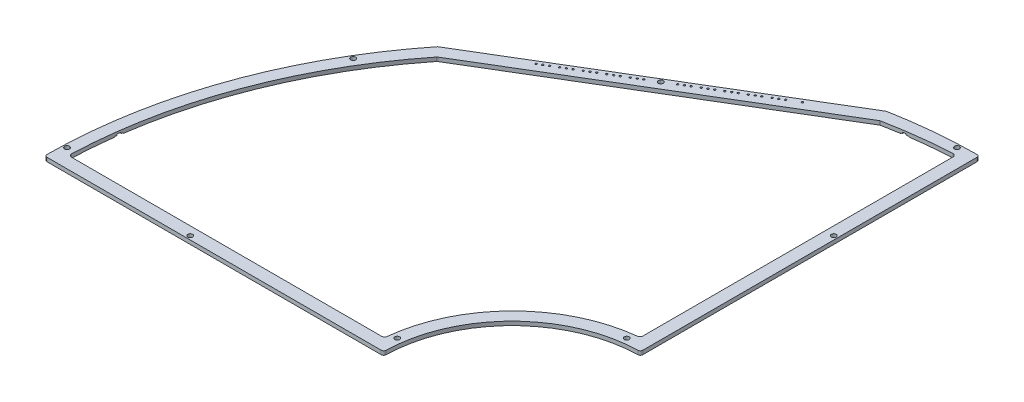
ISO-10303-21;
HEADER;
FILE_DESCRIPTION(('STEP AP214'),'2;1');
FILE_NAME('part.step','',(''),(''),'','','');
FILE_SCHEMA(('AUTOMOTIVE_DESIGN { 1 0 10303 214 1 1 1 1 }'));
ENDSEC;
DATA;
#1=APPLICATION_CONTEXT('core data for automotive mechanical design processes');
#2=APPLICATION_PROTOCOL_DEFINITION('international standard','automotive_design',2000,#1);
#3=PRODUCT_CONTEXT('',#1,'mechanical');
#4=PRODUCT('Part','Part','',(#3));
#5=PRODUCT_RELATED_PRODUCT_CATEGORY('part','',(#4));
#6=PRODUCT_DEFINITION_FORMATION('','',#4);
#7=PRODUCT_DEFINITION_CONTEXT('part definition',#1,'design');
#8=PRODUCT_DEFINITION('design','',#6,#7);
#9=PRODUCT_DEFINITION_SHAPE('','',#8);
#10=(LENGTH_UNIT() NAMED_UNIT(*) SI_UNIT(.MILLI.,.METRE.));
#11=(NAMED_UNIT(*) PLANE_ANGLE_UNIT() SI_UNIT($,.RADIAN.));
#12=(NAMED_UNIT(*) SI_UNIT($,.STERADIAN.) SOLID_ANGLE_UNIT());
#13=UNCERTAINTY_MEASURE_WITH_UNIT(LENGTH_MEASURE(1.E-05),#10,'distance_accuracy_value','');
#14=(GEOMETRIC_REPRESENTATION_CONTEXT(3) GLOBAL_UNCERTAINTY_ASSIGNED_CONTEXT((#13)) GLOBAL_UNIT_ASSIGNED_CONTEXT((#10,
#11,#12)) REPRESENTATION_CONTEXT('',''));
#15=CARTESIAN_POINT('',(0.,0.,0.));
#16=DIRECTION('',(0.,0.,1.));
#17=DIRECTION('',(1.,0.,0.));
#18=AXIS2_PLACEMENT_3D('',#15,#16,#17);
#19=CARTESIAN_POINT('',(0.,0.,0.));
#20=DIRECTION('',(0.,-1.,0.));
#21=DIRECTION('',(0.,0.,-1.));
#22=AXIS2_PLACEMENT_3D('',#19,#20,#21);
#23=PLANE('',#22);
#24=CARTESIAN_POINT('',(-110.321425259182,0.,-346.700422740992));
#25=DIRECTION('',(0.,-1.,0.));
#26=DIRECTION('',(0.,0.,-1.));
#27=AXIS2_PLACEMENT_3D('',#24,#25,#26);
#28=CIRCLE('',#27,0.749999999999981);
#29=CARTESIAN_POINT('',(-110.321425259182,0.,-347.450422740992));
#30=VERTEX_POINT('',#29);
#31=EDGE_CURVE('E385',#30,#30,#28,.T.);
#32=ORIENTED_EDGE('',*,*,#31,.F.);
#33=EDGE_LOOP('',(#32));
#34=FACE_BOUND('',#33,.T.);
#35=CARTESIAN_POINT('',(-173.751805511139,0.,-308.587605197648));
#36=DIRECTION('',(0.,-1.,0.));
#37=DIRECTION('',(0.,0.,1.));
#38=AXIS2_PLACEMENT_3D('',#35,#36,#37);
#39=CIRCLE('',#38,0.74999999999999);
#40=CARTESIAN_POINT('',(-173.751805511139,0.,-307.837605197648));
#41=VERTEX_POINT('',#40);
#42=EDGE_CURVE('E391',#41,#41,#39,.T.);
#43=ORIENTED_EDGE('',*,*,#42,.F.);
#44=EDGE_LOOP('',(#43));
#45=FACE_BOUND('',#44,.T.);
#46=CARTESIAN_POINT('',(-161.751463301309,0.,-315.798138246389));
#47=DIRECTION('',(0.,-1.,0.));
#48=DIRECTION('',(0.,0.,1.));
#49=AXIS2_PLACEMENT_3D('',#46,#47,#48);
#50=CIRCLE('',#49,0.750000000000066);
#51=CARTESIAN_POINT('',(-161.751463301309,0.,-315.048138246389));
#52=VERTEX_POINT('',#51);
#53=EDGE_CURVE('E397',#52,#52,#50,.T.);
#54=ORIENTED_EDGE('',*,*,#53,.F.);
#55=EDGE_LOOP('',(#54));
#56=FACE_BOUND('',#55,.T.);
#57=CARTESIAN_POINT('',(-158.322794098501,0.,-317.858290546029));
#58=DIRECTION('',(0.,-1.,0.));
#59=DIRECTION('',(0.,0.,1.));
#60=AXIS2_PLACEMENT_3D('',#57,#58,#59);
#61=CIRCLE('',#60,0.750000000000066);
#62=CARTESIAN_POINT('',(-158.322794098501,0.,-317.108290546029));
#63=VERTEX_POINT('',#62);
#64=EDGE_CURVE('E403',#63,#63,#61,.T.);
#65=ORIENTED_EDGE('',*,*,#64,.F.);
#66=EDGE_LOOP('',(#65));
#67=FACE_BOUND('',#66,.T.);
#68=CARTESIAN_POINT('',(-170.32313630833,0.,-310.647757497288));
#69=DIRECTION('',(0.,-1.,0.));
#70=DIRECTION('',(0.,0.,1.));
#71=AXIS2_PLACEMENT_3D('',#68,#69,#70);
#72=CIRCLE('',#71,0.750000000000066);
#73=CARTESIAN_POINT('',(-170.32313630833,0.,-309.897757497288));
#74=VERTEX_POINT('',#73);
#75=EDGE_CURVE('E409',#74,#74,#72,.T.);
#76=ORIENTED_EDGE('',*,*,#75,.F.);
#77=EDGE_LOOP('',(#76));
#78=FACE_BOUND('',#77,.T.);
#79=CARTESIAN_POINT('',(-166.894467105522,0.,-312.707909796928));
#80=DIRECTION('',(0.,-1.,0.));
#81=DIRECTION('',(0.,0.,1.));
#82=AXIS2_PLACEMENT_3D('',#79,#80,#81);
#83=CIRCLE('',#82,0.74999999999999);
#84=CARTESIAN_POINT('',(-166.894467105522,0.,-311.957909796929));
#85=VERTEX_POINT('',#84);
#86=EDGE_CURVE('E415',#85,#85,#83,.T.);
#87=ORIENTED_EDGE('',*,*,#86,.F.);
#88=EDGE_LOOP('',(#87));
#89=FACE_BOUND('',#88,.T.);
#90=CARTESIAN_POINT('',(-154.894124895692,0.,-319.918442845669));
#91=DIRECTION('',(0.,-1.,0.));
#92=DIRECTION('',(0.,0.,1.));
#93=AXIS2_PLACEMENT_3D('',#90,#91,#92);
#94=CIRCLE('',#93,0.750000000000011);
#95=CARTESIAN_POINT('',(-154.894124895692,0.,-319.168442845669));
#96=VERTEX_POINT('',#95);
#97=EDGE_CURVE('E421',#96,#96,#94,.T.);
#98=ORIENTED_EDGE('',*,*,#97,.F.);
#99=EDGE_LOOP('',(#98));
#100=FACE_BOUND('',#99,.T.);
#101=CARTESIAN_POINT('',(-149.751121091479,0.,-323.00867129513));
#102=DIRECTION('',(0.,-1.,0.));
#103=DIRECTION('',(0.,0.,1.));
#104=AXIS2_PLACEMENT_3D('',#101,#102,#103);
#105=CIRCLE('',#104,0.750000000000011);
#106=CARTESIAN_POINT('',(-149.751121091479,0.,-322.25867129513));
#107=VERTEX_POINT('',#106);
#108=EDGE_CURVE('E427',#107,#107,#105,.T.);
#109=ORIENTED_EDGE('',*,*,#108,.F.);
#110=EDGE_LOOP('',(#109));
#111=FACE_BOUND('',#110,.T.);
#112=CARTESIAN_POINT('',(-146.322451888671,0.,-325.06882359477));
#113=DIRECTION('',(0.,-1.,0.));
#114=DIRECTION('',(0.,0.,1.));
#115=AXIS2_PLACEMENT_3D('',#112,#113,#114);
#116=CIRCLE('',#115,0.750000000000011);
#117=CARTESIAN_POINT('',(-146.322451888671,0.,-324.31882359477));
#118=VERTEX_POINT('',#117);
#119=EDGE_CURVE('E433',#118,#118,#116,.T.);
#120=ORIENTED_EDGE('',*,*,#119,.F.);
#121=EDGE_LOOP('',(#120));
#122=FACE_BOUND('',#121,.T.);
#123=CARTESIAN_POINT('',(-142.893782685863,0.,-327.12897589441));
#124=DIRECTION('',(0.,-1.,0.));
#125=DIRECTION('',(0.,0.,1.));
#126=AXIS2_PLACEMENT_3D('',#123,#124,#125);
#127=CIRCLE('',#126,0.749999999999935);
#128=CARTESIAN_POINT('',(-142.893782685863,0.,-326.37897589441));
#129=VERTEX_POINT('',#128);
#130=EDGE_CURVE('E439',#129,#129,#127,.T.);
#131=ORIENTED_EDGE('',*,*,#130,.F.);
#132=EDGE_LOOP('',(#131));
#133=FACE_BOUND('',#132,.T.);
#134=CARTESIAN_POINT('',(-137.75077888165,0.,-330.219204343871));
#135=DIRECTION('',(0.,-1.,0.));
#136=DIRECTION('',(0.,0.,1.));
#137=AXIS2_PLACEMENT_3D('',#134,#135,#136);
#138=CIRCLE('',#137,0.749999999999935);
#139=CARTESIAN_POINT('',(-137.75077888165,0.,-329.469204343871));
#140=VERTEX_POINT('',#139);
#141=EDGE_CURVE('E445',#140,#140,#138,.T.);
#142=ORIENTED_EDGE('',*,*,#141,.F.);
#143=EDGE_LOOP('',(#142));
#144=FACE_BOUND('',#143,.T.);
#145=CARTESIAN_POINT('',(-134.322109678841,0.,-332.279356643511));
#146=DIRECTION('',(0.,-1.,0.));
#147=DIRECTION('',(0.,0.,1.));
#148=AXIS2_PLACEMENT_3D('',#145,#146,#147);
#149=CIRCLE('',#148,0.749999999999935);
#150=CARTESIAN_POINT('',(-134.322109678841,0.,-331.529356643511));
#151=VERTEX_POINT('',#150);
#152=EDGE_CURVE('E451',#151,#151,#149,.T.);
#153=ORIENTED_EDGE('',*,*,#152,.F.);
#154=EDGE_LOOP('',(#153));
#155=FACE_BOUND('',#154,.T.);
#156=CARTESIAN_POINT('',(-130.893440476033,0.,-334.339508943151));
#157=DIRECTION('',(0.,-1.,0.));
#158=DIRECTION('',(0.,0.,1.));
#159=AXIS2_PLACEMENT_3D('',#156,#157,#158);
#160=CIRCLE('',#159,0.749999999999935);
#161=CARTESIAN_POINT('',(-130.893440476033,0.,-333.589508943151));
#162=VERTEX_POINT('',#161);
#163=EDGE_CURVE('E457',#162,#162,#160,.T.);
#164=ORIENTED_EDGE('',*,*,#163,.F.);
#165=EDGE_LOOP('',(#164));
#166=FACE_BOUND('',#165,.T.);
#167=CARTESIAN_POINT('',(-125.75043667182,0.,-337.429737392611));
#168=DIRECTION('',(0.,-1.,0.));
#169=DIRECTION('',(0.,0.,1.));
#170=AXIS2_PLACEMENT_3D('',#167,#168,#169);
#171=CIRCLE('',#170,0.749999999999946);
#172=CARTESIAN_POINT('',(-125.75043667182,0.,-336.679737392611));
#173=VERTEX_POINT('',#172);
#174=EDGE_CURVE('E463',#173,#173,#171,.T.);
#175=ORIENTED_EDGE('',*,*,#174,.F.);
#176=EDGE_LOOP('',(#175));
#177=FACE_BOUND('',#176,.T.);
#178=CARTESIAN_POINT('',(-122.321767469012,0.,-339.489889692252));
#179=DIRECTION('',(0.,-1.,0.));
#180=DIRECTION('',(0.,0.,1.));
#181=AXIS2_PLACEMENT_3D('',#178,#179,#180);
#182=CIRCLE('',#181,0.750000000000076);
#183=CARTESIAN_POINT('',(-122.321767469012,0.,-338.739889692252));
#184=VERTEX_POINT('',#183);
#185=EDGE_CURVE('E469',#184,#184,#182,.T.);
#186=ORIENTED_EDGE('',*,*,#185,.F.);
#187=EDGE_LOOP('',(#186));
#188=FACE_BOUND('',#187,.T.);
#189=CARTESIAN_POINT('',(-245.753858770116,0.,-265.324406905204));
#190=DIRECTION('',(0.,-1.,0.));
#191=DIRECTION('',(0.,0.,-1.));
#192=AXIS2_PLACEMENT_3D('',#189,#190,#191);
#193=CIRCLE('',#192,0.750000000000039);
#194=CARTESIAN_POINT('',(-245.753858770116,0.,-266.074406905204));
#195=VERTEX_POINT('',#194);
#196=EDGE_CURVE('E475',#195,#195,#193,.T.);
#197=ORIENTED_EDGE('',*,*,#196,.F.);
#198=EDGE_LOOP('',(#197));
#199=FACE_BOUND('',#198,.T.);
#200=CARTESIAN_POINT('',(-242.325189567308,0.,-267.384559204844));
#201=DIRECTION('',(0.,-1.,0.));
#202=DIRECTION('',(0.,0.,-1.));
#203=AXIS2_PLACEMENT_3D('',#200,#201,#202);
#204=CIRCLE('',#203,0.750000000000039);
#205=CARTESIAN_POINT('',(-242.325189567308,0.,-268.134559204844));
#206=VERTEX_POINT('',#205);
#207=EDGE_CURVE('E481',#206,#206,#204,.T.);
#208=ORIENTED_EDGE('',*,*,#207,.F.);
#209=EDGE_LOOP('',(#208));
#210=FACE_BOUND('',#209,.T.);
#211=CARTESIAN_POINT('',(-238.896520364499,0.,-269.444711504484));
#212=DIRECTION('',(0.,-1.,0.));
#213=DIRECTION('',(0.,0.,-1.));
#214=AXIS2_PLACEMENT_3D('',#211,#212,#213);
#215=CIRCLE('',#214,0.749999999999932);
#216=CARTESIAN_POINT('',(-238.896520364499,0.,-270.194711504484));
#217=VERTEX_POINT('',#216);
#218=EDGE_CURVE('E487',#217,#217,#215,.T.);
#219=ORIENTED_EDGE('',*,*,#218,.F.);
#220=EDGE_LOOP('',(#219));
#221=FACE_BOUND('',#220,.T.);
#222=CARTESIAN_POINT('',(-233.753516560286,0.,-272.534939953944));
#223=DIRECTION('',(0.,-1.,0.));
#224=DIRECTION('',(0.,0.,-1.));
#225=AXIS2_PLACEMENT_3D('',#222,#223,#224);
#226=CIRCLE('',#225,0.749999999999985);
#227=CARTESIAN_POINT('',(-233.753516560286,0.,-273.284939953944));
#228=VERTEX_POINT('',#227);
#229=EDGE_CURVE('E493',#228,#228,#226,.T.);
#230=ORIENTED_EDGE('',*,*,#229,.F.);
#231=EDGE_LOOP('',(#230));
#232=FACE_BOUND('',#231,.T.);
#233=CARTESIAN_POINT('',(-230.324847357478,0.,-274.595092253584));
#234=DIRECTION('',(0.,-1.,0.));
#235=DIRECTION('',(0.,0.,-1.));
#236=AXIS2_PLACEMENT_3D('',#233,#234,#235);
#237=CIRCLE('',#236,0.749999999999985);
#238=CARTESIAN_POINT('',(-230.324847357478,0.,-275.345092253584));
#239=VERTEX_POINT('',#238);
#240=EDGE_CURVE('E499',#239,#239,#237,.T.);
#241=ORIENTED_EDGE('',*,*,#240,.F.);
#242=EDGE_LOOP('',(#241));
#243=FACE_BOUND('',#242,.T.);
#244=CARTESIAN_POINT('',(-226.896178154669,0.,-276.655244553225));
#245=DIRECTION('',(0.,-1.,0.));
#246=DIRECTION('',(0.,0.,-1.));
#247=AXIS2_PLACEMENT_3D('',#244,#245,#246);
#248=CIRCLE('',#247,0.749999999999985);
#249=CARTESIAN_POINT('',(-226.896178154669,0.,-277.405244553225));
#250=VERTEX_POINT('',#249);
#251=EDGE_CURVE('E505',#250,#250,#248,.T.);
#252=ORIENTED_EDGE('',*,*,#251,.F.);
#253=EDGE_LOOP('',(#252));
#254=FACE_BOUND('',#253,.T.);
#255=CARTESIAN_POINT('',(-221.753174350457,0.,-279.745473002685));
#256=DIRECTION('',(0.,-1.,0.));
#257=DIRECTION('',(0.,0.,-1.));
#258=AXIS2_PLACEMENT_3D('',#255,#256,#257);
#259=CIRCLE('',#258,0.749999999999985);
#260=CARTESIAN_POINT('',(-221.753174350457,0.,-280.495473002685));
#261=VERTEX_POINT('',#260);
#262=EDGE_CURVE('E511',#261,#261,#259,.T.);
#263=ORIENTED_EDGE('',*,*,#262,.F.);
#264=EDGE_LOOP('',(#263));
#265=FACE_BOUND('',#264,.T.);
#266=CARTESIAN_POINT('',(-218.324505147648,0.,-281.805625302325));
#267=DIRECTION('',(0.,-1.,0.));
#268=DIRECTION('',(0.,0.,-1.));
#269=AXIS2_PLACEMENT_3D('',#266,#267,#268);
#270=CIRCLE('',#269,0.749999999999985);
#271=CARTESIAN_POINT('',(-218.324505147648,0.,-282.555625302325));
#272=VERTEX_POINT('',#271);
#273=EDGE_CURVE('E517',#272,#272,#270,.T.);
#274=ORIENTED_EDGE('',*,*,#273,.F.);
#275=EDGE_LOOP('',(#274));
#276=FACE_BOUND('',#275,.T.);
#277=CARTESIAN_POINT('',(-214.89583594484,0.,-283.865777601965));
#278=DIRECTION('',(0.,-1.,0.));
#279=DIRECTION('',(0.,0.,-1.));
#280=AXIS2_PLACEMENT_3D('',#277,#278,#279);
#281=CIRCLE('',#280,0.749999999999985);
#282=CARTESIAN_POINT('',(-214.89583594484,0.,-284.615777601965));
#283=VERTEX_POINT('',#282);
#284=EDGE_CURVE('E523',#283,#283,#281,.T.);
#285=ORIENTED_EDGE('',*,*,#284,.F.);
#286=EDGE_LOOP('',(#285));
#287=FACE_BOUND('',#286,.T.);
#288=CARTESIAN_POINT('',(-209.752832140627,0.,-286.956006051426));
#289=DIRECTION('',(0.,-1.,0.));
#290=DIRECTION('',(0.,0.,-1.));
#291=AXIS2_PLACEMENT_3D('',#288,#289,#290);
#292=CIRCLE('',#291,0.749999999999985);
#293=CARTESIAN_POINT('',(-209.752832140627,0.,-287.706006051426));
#294=VERTEX_POINT('',#293);
#295=EDGE_CURVE('E529',#294,#294,#292,.T.);
#296=ORIENTED_EDGE('',*,*,#295,.F.);
#297=EDGE_LOOP('',(#296));
#298=FACE_BOUND('',#297,.T.);
#299=CARTESIAN_POINT('',(-197.752489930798,0.,-294.166539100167));
#300=DIRECTION('',(0.,-1.,0.));
#301=DIRECTION('',(0.,0.,-1.));
#302=AXIS2_PLACEMENT_3D('',#299,#300,#301);
#303=CIRCLE('',#302,0.749999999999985);
#304=CARTESIAN_POINT('',(-197.752489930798,0.,-294.916539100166));
#305=VERTEX_POINT('',#304);
#306=EDGE_CURVE('E535',#305,#305,#303,.T.);
#307=ORIENTED_EDGE('',*,*,#306,.F.);
#308=EDGE_LOOP('',(#307));
#309=FACE_BOUND('',#308,.T.);
#310=CARTESIAN_POINT('',(-194.323820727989,0.,-296.226691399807));
#311=DIRECTION('',(0.,-1.,0.));
#312=DIRECTION('',(0.,0.,-1.));
#313=AXIS2_PLACEMENT_3D('',#310,#311,#312);
#314=CIRCLE('',#313,0.749999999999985);
#315=CARTESIAN_POINT('',(-194.323820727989,0.,-296.976691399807));
#316=VERTEX_POINT('',#315);
#317=EDGE_CURVE('E541',#316,#316,#314,.T.);
#318=ORIENTED_EDGE('',*,*,#317,.F.);
#319=EDGE_LOOP('',(#318));
#320=FACE_BOUND('',#319,.T.);
#321=CARTESIAN_POINT('',(-206.324162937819,0.,-289.016158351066));
#322=DIRECTION('',(0.,-1.,0.));
#323=DIRECTION('',(0.,0.,-1.));
#324=AXIS2_PLACEMENT_3D('',#321,#322,#323);
#325=CIRCLE('',#324,0.749999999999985);
#326=CARTESIAN_POINT('',(-206.324162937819,0.,-289.766158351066));
#327=VERTEX_POINT('',#326);
#328=EDGE_CURVE('E547',#327,#327,#325,.T.);
#329=ORIENTED_EDGE('',*,*,#328,.F.);
#330=EDGE_LOOP('',(#329));
#331=FACE_BOUND('',#330,.T.);
#332=CARTESIAN_POINT('',(-202.89549373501,0.,-291.076310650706));
#333=DIRECTION('',(0.,-1.,0.));
#334=DIRECTION('',(0.,0.,-1.));
#335=AXIS2_PLACEMENT_3D('',#332,#333,#334);
#336=CIRCLE('',#335,0.749999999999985);
#337=CARTESIAN_POINT('',(-202.89549373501,0.,-291.826310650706));
#338=VERTEX_POINT('',#337);
#339=EDGE_CURVE('E553',#338,#338,#336,.T.);
#340=ORIENTED_EDGE('',*,*,#339,.F.);
#341=EDGE_LOOP('',(#340));
#342=FACE_BOUND('',#341,.T.);
#343=CARTESIAN_POINT('',(-118.893098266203,0.,-341.550041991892));
#344=DIRECTION('',(0.,-1.,0.));
#345=DIRECTION('',(0.,0.,1.));
#346=AXIS2_PLACEMENT_3D('',#343,#344,#345);
#347=CIRCLE('',#346,0.75);
#348=CARTESIAN_POINT('',(-118.893098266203,0.,-340.800041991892));
#349=VERTEX_POINT('',#348);
#350=EDGE_CURVE('E559',#349,#349,#347,.T.);
#351=ORIENTED_EDGE('',*,*,#350,.F.);
#352=EDGE_LOOP('',(#351));
#353=FACE_BOUND('',#352,.T.);
#354=CARTESIAN_POINT('',(-190.895151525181,0.,-298.286843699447));
#355=DIRECTION('',(0.,-1.,0.));
#356=DIRECTION('',(0.,0.,-1.));
#357=AXIS2_PLACEMENT_3D('',#354,#355,#356);
#358=CIRCLE('',#357,0.749999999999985);
#359=CARTESIAN_POINT('',(-190.895151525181,0.,-299.036843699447));
#360=VERTEX_POINT('',#359);
#361=EDGE_CURVE('E565',#360,#360,#358,.T.);
#362=ORIENTED_EDGE('',*,*,#361,.F.);
#363=EDGE_LOOP('',(#362));
#364=FACE_BOUND('',#363,.T.);
#365=CARTESIAN_POINT('',(-3.49999999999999,0.,-265.406923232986));
#366=DIRECTION('',(0.,1.,0.));
#367=DIRECTION('',(0.,0.,1.));
#368=AXIS2_PLACEMENT_3D('',#365,#366,#367);
#369=CIRCLE('',#368,1.99999999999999);
#370=CARTESIAN_POINT('',(-3.49999999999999,0.,-263.406923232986));
#371=VERTEX_POINT('',#370);
#372=EDGE_CURVE('E577',#371,#371,#369,.T.);
#373=ORIENTED_EDGE('',*,*,#372,.T.);
#374=EDGE_LOOP('',(#373));
#375=FACE_BOUND('',#374,.T.);
#376=CARTESIAN_POINT('',(-15.5,0.,-108.90247931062));
#377=DIRECTION('',(0.,1.,0.));
#378=DIRECTION('',(0.,0.,1.));
#379=AXIS2_PLACEMENT_3D('',#376,#377,#378);
#380=CIRCLE('',#379,2.);
#381=CARTESIAN_POINT('',(-15.5,0.,-106.90247931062));
#382=VERTEX_POINT('',#381);
#383=EDGE_CURVE('E589',#382,#382,#380,.T.);
#384=ORIENTED_EDGE('',*,*,#383,.T.);
#385=EDGE_LOOP('',(#384));
#386=FACE_BOUND('',#385,.T.);
#387=CARTESIAN_POINT('',(-108.90247931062,0.,-15.5));
#388=DIRECTION('',(0.,1.,0.));
#389=DIRECTION('',(0.,0.,1.));
#390=AXIS2_PLACEMENT_3D('',#387,#388,#389);
#391=CIRCLE('',#390,1.99999999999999);
#392=CARTESIAN_POINT('',(-108.90247931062,0.,-13.5));
#393=VERTEX_POINT('',#392);
#394=EDGE_CURVE('E601',#393,#393,#391,.T.);
#395=ORIENTED_EDGE('',*,*,#394,.T.);
#396=EDGE_LOOP('',(#395));
#397=FACE_BOUND('',#396,.T.);
#398=CARTESIAN_POINT('',(-377.682075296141,0.,-15.4999999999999));
#399=DIRECTION('',(0.,1.,0.));
#400=DIRECTION('',(0.,0.,1.));
#401=AXIS2_PLACEMENT_3D('',#398,#399,#400);
#402=CIRCLE('',#401,2.00000000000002);
#403=CARTESIAN_POINT('',(-377.682075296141,0.,-13.4999999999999));
#404=VERTEX_POINT('',#403);
#405=EDGE_CURVE('E613',#404,#404,#402,.T.);
#406=ORIENTED_EDGE('',*,*,#405,.T.);
#407=EDGE_LOOP('',(#406));
#408=FACE_BOUND('',#407,.T.);
#409=DIRECTION('',(1.,0.,0.));
#410=VECTOR('',#409,1.);
#411=CARTESIAN_POINT('',(-104.998809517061,0.,-0.499999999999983));
#412=LINE('',#411,#410);
#413=CARTESIAN_POINT('',(-378.991754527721,0.,-0.499999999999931));
#414=VERTEX_POINT('',#413);
#415=CARTESIAN_POINT('',(-106.970790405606,0.,-0.499999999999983));
#416=VERTEX_POINT('',#415);
#417=EDGE_CURVE('E734',#414,#416,#412,.T.);
#418=ORIENTED_EDGE('',*,*,#417,.F.);
#419=CARTESIAN_POINT('',(-378.991754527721,0.,-2.49999999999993));
#420=DIRECTION('',(0.,-1.,0.));
#421=DIRECTION('',(0.,0.,-1.));
#422=AXIS2_PLACEMENT_3D('',#419,#420,#421);
#423=CIRCLE('',#422,2.);
#424=CARTESIAN_POINT('',(-380.991711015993,0.,-2.51319261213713));
#425=VERTEX_POINT('',#424);
#426=EDGE_CURVE('E784',#414,#425,#423,.T.);
#427=ORIENTED_EDGE('',*,*,#426,.T.);
#428=CARTESIAN_POINT('',(0.,0.,0.));
#429=DIRECTION('',(0.,1.,0.));
#430=DIRECTION('',(0.,0.,-1.));
#431=AXIS2_PLACEMENT_3D('',#428,#429,#430);
#432=CIRCLE('',#431,381.);
#433=CARTESIAN_POINT('',(-297.945935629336,0.,-237.464143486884));
#434=VERTEX_POINT('',#433);
#435=EDGE_CURVE('E731',#434,#425,#432,.T.);
#436=ORIENTED_EDGE('',*,*,#435,.F.);
#437=DIRECTION('',(-0.857167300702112,0.,0.515038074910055));
#438=VECTOR('',#437,1.);
#439=CARTESIAN_POINT('',(-69.7912498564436,0.,-374.553309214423));
#440=LINE('',#439,#438);
#441=CARTESIAN_POINT('',(-69.7912498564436,0.,-374.553309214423));
#442=VERTEX_POINT('',#441);
#443=EDGE_CURVE('E729',#442,#434,#440,.T.);
#444=ORIENTED_EDGE('',*,*,#443,.F.);
#445=CARTESIAN_POINT('',(0.,0.,0.));
#446=DIRECTION('',(0.,1.,0.));
#447=DIRECTION('',(0.,0.,-1.));
#448=AXIS2_PLACEMENT_3D('',#445,#446,#447);
#449=CIRCLE('',#448,381.);
#450=CARTESIAN_POINT('',(-2.5131926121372,0.,-380.991711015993));
#451=VERTEX_POINT('',#450);
#452=EDGE_CURVE('E711',#451,#442,#449,.T.);
#453=ORIENTED_EDGE('',*,*,#452,.F.);
#454=CARTESIAN_POINT('',(-2.5,0.,-378.991754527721));
#455=DIRECTION('',(0.,-1.,0.));
#456=DIRECTION('',(0.,0.,-1.));
#457=AXIS2_PLACEMENT_3D('',#454,#455,#456);
#458=CIRCLE('',#457,2.);
#459=CARTESIAN_POINT('',(-0.5,0.,-378.991754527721));
#460=VERTEX_POINT('',#459);
#461=EDGE_CURVE('E782',#451,#460,#458,.T.);
#462=ORIENTED_EDGE('',*,*,#461,.T.);
#463=DIRECTION('',(0.,0.,-1.));
#464=VECTOR('',#463,1.);
#465=CARTESIAN_POINT('',(-0.499999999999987,0.,-104.998809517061));
#466=LINE('',#465,#464);
#467=CARTESIAN_POINT('',(-0.499999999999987,0.,-106.970790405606));
#468=VERTEX_POINT('',#467);
#469=EDGE_CURVE('E715',#468,#460,#466,.T.);
#470=ORIENTED_EDGE('',*,*,#469,.F.);
#471=CARTESIAN_POINT('',(-2.49999999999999,0.,-106.970790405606));
#472=DIRECTION('',(0.,-1.,0.));
#473=DIRECTION('',(0.,0.,-1.));
#474=AXIS2_PLACEMENT_3D('',#471,#472,#473);
#475=CIRCLE('',#474,2.);
#476=CARTESIAN_POINT('',(-2.45327102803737,0.,-104.971336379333));
#477=VERTEX_POINT('',#476);
#478=EDGE_CURVE('E778',#468,#477,#475,.T.);
#479=ORIENTED_EDGE('',*,*,#478,.T.);
#480=CARTESIAN_POINT('',(0.,0.,0.));
#481=DIRECTION('',(0.,-1.,0.));
#482=DIRECTION('',(0.,0.,-1.));
#483=AXIS2_PLACEMENT_3D('',#480,#481,#482);
#484=CIRCLE('',#483,105.);
#485=CARTESIAN_POINT('',(-104.971336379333,0.,-2.45327102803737));
#486=VERTEX_POINT('',#485);
#487=EDGE_CURVE('E737',#486,#477,#484,.T.);
#488=ORIENTED_EDGE('',*,*,#487,.F.);
#489=CARTESIAN_POINT('',(-106.970790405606,0.,-2.49999999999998));
#490=DIRECTION('',(0.,-1.,0.));
#491=DIRECTION('',(0.,0.,-1.));
#492=AXIS2_PLACEMENT_3D('',#489,#490,#491);
#493=CIRCLE('',#492,2.);
#494=EDGE_CURVE('E780',#486,#416,#493,.T.);
#495=ORIENTED_EDGE('',*,*,#494,.T.);
#496=EDGE_LOOP('',(#418,#427,#436,#444,#453,#462,#470,#479,#488,#495));
#497=FACE_BOUND('',#496,.T.);
#498=CARTESIAN_POINT('',(-324.009239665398,0.,-194.684392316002));
#499=DIRECTION('',(0.,1.,0.));
#500=DIRECTION('',(0.,0.,1.));
#501=AXIS2_PLACEMENT_3D('',#498,#499,#500);
#502=CIRCLE('',#501,1.99999999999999);
#503=CARTESIAN_POINT('',(-324.009239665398,0.,-192.684392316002));
#504=VERTEX_POINT('',#503);
#505=EDGE_CURVE('E607',#504,#504,#502,.T.);
#506=ORIENTED_EDGE('',*,*,#505,.T.);
#507=EDGE_LOOP('',(#506));
#508=FACE_BOUND('',#507,.T.);
#509=CARTESIAN_POINT('',(-182.32347851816,0.,-303.437224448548));
#510=DIRECTION('',(0.,1.,0.));
#511=DIRECTION('',(0.,0.,1.));
#512=AXIS2_PLACEMENT_3D('',#509,#510,#511);
#513=CIRCLE('',#512,1.99999999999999);
#514=CARTESIAN_POINT('',(-182.32347851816,0.,-301.437224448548));
#515=VERTEX_POINT('',#514);
#516=EDGE_CURVE('E595',#515,#515,#513,.T.);
#517=ORIENTED_EDGE('',*,*,#516,.T.);
#518=EDGE_LOOP('',(#517));
#519=FACE_BOUND('',#518,.T.);
#520=CARTESIAN_POINT('',(-15.5,0.,-377.682075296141));
#521=DIRECTION('',(0.,1.,0.));
#522=DIRECTION('',(0.,0.,1.));
#523=AXIS2_PLACEMENT_3D('',#520,#521,#522);
#524=CIRCLE('',#523,1.99999999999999);
#525=CARTESIAN_POINT('',(-15.5,0.,-375.682075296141));
#526=VERTEX_POINT('',#525);
#527=EDGE_CURVE('E583',#526,#526,#524,.T.);
#528=ORIENTED_EDGE('',*,*,#527,.T.);
#529=EDGE_LOOP('',(#528));
#530=FACE_BOUND('',#529,.T.);
#531=CARTESIAN_POINT('',(-265.406923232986,0.,-3.49999999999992));
#532=DIRECTION('',(0.,1.,0.));
#533=DIRECTION('',(0.,0.,1.));
#534=AXIS2_PLACEMENT_3D('',#531,#532,#533);
#535=CIRCLE('',#534,1.99999999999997);
#536=CARTESIAN_POINT('',(-265.406923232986,0.,-1.49999999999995));
#537=VERTEX_POINT('',#536);
#538=EDGE_CURVE('E571',#537,#537,#535,.T.);
#539=ORIENTED_EDGE('',*,*,#538,.T.);
#540=EDGE_LOOP('',(#539));
#541=FACE_BOUND('',#540,.T.);
#542=CARTESIAN_POINT('',(-0.733890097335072,0.,1.14712226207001));
#543=DIRECTION('',(0.,1.,0.));
#544=DIRECTION('',(0.,0.,-1.));
#545=AXIS2_PLACEMENT_3D('',#542,#543,#544);
#546=CIRCLE('',#545,371.);
#547=CARTESIAN_POINT('',(-291.17248521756,0.,-229.691398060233));
#548=VERTEX_POINT('',#547);
#549=CARTESIAN_POINT('',(-367.983459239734,0.,-51.4718283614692));
#550=VERTEX_POINT('',#549);
#551=EDGE_CURVE('E625',#548,#550,#546,.T.);
#552=ORIENTED_EDGE('',*,*,#551,.T.);
#553=DIRECTION('',(-0.991444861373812,0.,-0.130526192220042));
#554=VECTOR('',#553,1.);
#555=CARTESIAN_POINT('',(-431054.473408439,0.,-56752.4239073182));
#556=LINE('',#555,#554);
#557=CARTESIAN_POINT('',(-372.391689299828,0.,-52.0521828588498));
#558=VERTEX_POINT('',#557);
#559=EDGE_CURVE('E317',#550,#558,#556,.T.);
#560=ORIENTED_EDGE('',*,*,#559,.T.);
#561=CARTESIAN_POINT('',(-372.783267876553,0.,-49.0778482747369));
#562=DIRECTION('',(0.,-1.,0.));
#563=DIRECTION('',(0.,0.,-1.));
#564=AXIS2_PLACEMENT_3D('',#561,#562,#563);
#565=CIRCLE('',#564,3.00000000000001);
#566=CARTESIAN_POINT('',(-373.174846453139,0.,-46.1035136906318));
#567=VERTEX_POINT('',#566);
#568=EDGE_CURVE('E329',#567,#558,#565,.T.);
#569=ORIENTED_EDGE('',*,*,#568,.F.);
#570=DIRECTION('',(-0.991444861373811,0.,-0.130526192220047));
#571=VECTOR('',#570,1.);
#572=CARTESIAN_POINT('',(-431055.256565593,0.,-56746.4752381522));
#573=LINE('',#572,#571);
#574=CARTESIAN_POINT('',(-368.786388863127,0.,-45.5257622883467));
#575=VERTEX_POINT('',#574);
#576=EDGE_CURVE('E321',#575,#567,#573,.T.);
#577=ORIENTED_EDGE('',*,*,#576,.F.);
#578=CARTESIAN_POINT('',(-371.46513236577,0.,-12.9718722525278));
#579=VERTEX_POINT('',#578);
#580=EDGE_CURVE('E682',#575,#579,#546,.T.);
#581=ORIENTED_EDGE('',*,*,#580,.T.);
#582=CARTESIAN_POINT('',(-369.08560737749,0.,-12.8812499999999));
#583=DIRECTION('',(0.,1.,0.));
#584=DIRECTION('',(0.,0.,1.));
#585=AXIS2_PLACEMENT_3D('',#582,#583,#584);
#586=CIRCLE('',#585,2.38125);
#587=CARTESIAN_POINT('',(-369.08560737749,0.,-10.4999999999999));
#588=VERTEX_POINT('',#587);
#589=EDGE_CURVE('E619',#579,#588,#586,.T.);
#590=ORIENTED_EDGE('',*,*,#589,.T.);
#591=DIRECTION('',(1.,0.,0.));
#592=VECTOR('',#591,1.);
#593=CARTESIAN_POINT('',(-116.627737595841,0.,-10.5));
#594=LINE('',#593,#592);
#595=CARTESIAN_POINT('',(-116.627737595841,0.,-10.5));
#596=VERTEX_POINT('',#595);
#597=EDGE_CURVE('E651',#588,#596,#594,.T.);
#598=ORIENTED_EDGE('',*,*,#597,.T.);
#599=CARTESIAN_POINT('',(-116.627737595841,0.,-12.88125));
#600=DIRECTION('',(0.,1.,0.));
#601=DIRECTION('',(0.,0.,1.));
#602=AXIS2_PLACEMENT_3D('',#599,#600,#601);
#603=CIRCLE('',#602,2.38124999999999);
#604=CARTESIAN_POINT('',(-114.260116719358,0.,-12.6268429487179));
#605=VERTEX_POINT('',#604);
#606=EDGE_CURVE('E654',#596,#605,#603,.T.);
#607=ORIENTED_EDGE('',*,*,#606,.T.);
#608=CARTESIAN_POINT('',(0.0816788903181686,0.,-0.340518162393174));
#609=DIRECTION('',(0.,-1.,0.));
#610=DIRECTION('',(0.,0.,-1.));
#611=AXIS2_PLACEMENT_3D('',#608,#609,#610);
#612=CIRCLE('',#611,115.);
#613=CARTESIAN_POINT('',(-12.6182780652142,0.,-114.637110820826));
#614=VERTEX_POINT('',#613);
#615=EDGE_CURVE('E657',#605,#614,#612,.T.);
#616=ORIENTED_EDGE('',*,*,#615,.T.);
#617=CARTESIAN_POINT('',(-12.88125,0.,-117.003795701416));
#618=DIRECTION('',(0.,1.,0.));
#619=DIRECTION('',(0.,0.,1.));
#620=AXIS2_PLACEMENT_3D('',#617,#618,#619);
#621=CIRCLE('',#620,2.38125);
#622=CARTESIAN_POINT('',(-10.5,0.,-117.003795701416));
#623=VERTEX_POINT('',#622);
#624=EDGE_CURVE('E660',#614,#623,#621,.T.);
#625=ORIENTED_EDGE('',*,*,#624,.T.);
#626=DIRECTION('',(0.,0.,-1.));
#627=VECTOR('',#626,1.);
#628=CARTESIAN_POINT('',(-10.5,0.,-117.003795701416));
#629=LINE('',#628,#627);
#630=CARTESIAN_POINT('',(-10.5,0.,-369.493251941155));
#631=VERTEX_POINT('',#630);
#632=EDGE_CURVE('E663',#623,#631,#629,.T.);
#633=ORIENTED_EDGE('',*,*,#632,.T.);
#634=CARTESIAN_POINT('',(-12.88125,0.,-369.493251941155));
#635=DIRECTION('',(0.,1.,0.));
#636=DIRECTION('',(0.,0.,1.));
#637=AXIS2_PLACEMENT_3D('',#634,#635,#636);
#638=CIRCLE('',#637,2.38125);
#639=CARTESIAN_POINT('',(-13.0051931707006,0.,-371.871274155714));
#640=VERTEX_POINT('',#639);
#641=EDGE_CURVE('E666',#631,#640,#638,.T.);
#642=ORIENTED_EDGE('',*,*,#641,.T.);
#643=CARTESIAN_POINT('',(6.30521788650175,0.,-1.37416482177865));
#644=DIRECTION('',(0.,1.,0.));
#645=DIRECTION('',(0.,0.,-1.));
#646=AXIS2_PLACEMENT_3D('',#643,#644,#645);
#647=CIRCLE('',#646,371.);
#648=CARTESIAN_POINT('',(-45.5192198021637,0.,-368.73669374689));
#649=VERTEX_POINT('',#648);
#650=EDGE_CURVE('E670',#640,#649,#647,.T.);
#651=ORIENTED_EDGE('',*,*,#650,.T.);
#652=DIRECTION('',(-0.130526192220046,0.,-0.991444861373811));
#653=VECTOR('',#652,1.);
#654=CARTESIAN_POINT('',(-44551.2755759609,0.,-338423.518575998));
#655=LINE('',#654,#653);
#656=CARTESIAN_POINT('',(-46.1035136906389,0.,-373.17484645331));
#657=VERTEX_POINT('',#656);
#658=EDGE_CURVE('E371',#649,#657,#655,.T.);
#659=ORIENTED_EDGE('',*,*,#658,.T.);
#660=CARTESIAN_POINT('',(-49.0778482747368,0.,-372.783267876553));
#661=DIRECTION('',(0.,-1.,0.));
#662=DIRECTION('',(0.,0.,-1.));
#663=AXIS2_PLACEMENT_3D('',#660,#661,#662);
#664=CIRCLE('',#663,3.);
#665=CARTESIAN_POINT('',(-52.0521828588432,0.,-372.391689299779));
#666=VERTEX_POINT('',#665);
#667=EDGE_CURVE('E378',#666,#657,#664,.T.);
#668=ORIENTED_EDGE('',*,*,#667,.F.);
#669=DIRECTION('',(-0.130526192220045,0.,-0.991444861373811));
#670=VECTOR('',#669,1.);
#671=CARTESIAN_POINT('',(-44557.2242451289,0.,-338422.735418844));
#672=LINE('',#671,#670);
#673=CARTESIAN_POINT('',(-51.4543118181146,0.,-367.850407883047));
#674=VERTEX_POINT('',#673);
#675=EDGE_CURVE('E367',#674,#666,#672,.T.);
#676=ORIENTED_EDGE('',*,*,#675,.F.);
#677=CARTESIAN_POINT('',(-65.3540665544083,0.,-365.387827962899));
#678=VERTEX_POINT('',#677);
#679=EDGE_CURVE('E669',#674,#678,#647,.T.);
#680=ORIENTED_EDGE('',*,*,#679,.T.);
#681=CARTESIAN_POINT('',(-64.8941240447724,0.,-363.051419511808));
#682=DIRECTION('',(0.,1.,0.));
#683=DIRECTION('',(0.,0.,1.));
#684=AXIS2_PLACEMENT_3D('',#681,#682,#683);
#685=CIRCLE('',#684,2.38125);
#686=CARTESIAN_POINT('',(-66.120558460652,0.,-365.092549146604));
#687=VERTEX_POINT('',#686);
#688=EDGE_CURVE('E673',#678,#687,#685,.T.);
#689=ORIENTED_EDGE('',*,*,#688,.T.);
#690=DIRECTION('',(-0.857167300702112,0.,0.515038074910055));
#691=VECTOR('',#690,1.);
#692=CARTESIAN_POINT('',(-66.120558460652,0.,-365.092549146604));
#693=LINE('',#692,#691);
#694=CARTESIAN_POINT('',(-290.534750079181,0.,-230.250899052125));
#695=VERTEX_POINT('',#694);
#696=EDGE_CURVE('E676',#687,#695,#693,.T.);
#697=ORIENTED_EDGE('',*,*,#696,.T.);
#698=CARTESIAN_POINT('',(-289.308315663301,0.,-228.209769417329));
#699=DIRECTION('',(0.,1.,0.));
#700=DIRECTION('',(0.,0.,1.));
#701=AXIS2_PLACEMENT_3D('',#698,#699,#700);
#702=CIRCLE('',#701,2.38124999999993);
#703=EDGE_CURVE('E679',#695,#548,#702,.T.);
#704=ORIENTED_EDGE('',*,*,#703,.T.);
#705=EDGE_LOOP('',(#552,#560,#569,#577,#581,#590,#598,#607,#616,#625,#633,#642,#651,#659,#668,
#676,#680,#689,#697,#704));
#706=FACE_BOUND('',#705,.T.);
#707=ADVANCED_FACE('F30',(#34,#45,#56,#67,#78,#89,#100,#111,#122,#133,#144,#155,#166,#177,#188,
#199,#210,#221,#232,#243,#254,#265,#276,#287,#298,#309,#320,#331,#342,#353,#364,#375,#386,#397,
#408,#497,#508,#519,#530,#541,#706),#23,.T.);
#708=CARTESIAN_POINT('',(-0.733890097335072,3.175,1.14712226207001));
#709=DIRECTION('',(0.,-1.,0.));
#710=DIRECTION('',(0.,0.,-1.));
#711=AXIS2_PLACEMENT_3D('',#708,#709,#710);
#712=CYLINDRICAL_SURFACE('',#711,371.);
#713=DIRECTION('',(0.,-1.,0.));
#714=VECTOR('',#713,1.);
#715=CARTESIAN_POINT('',(-368.606348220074,3.175,-46.9242263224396));
#716=LINE('',#715,#714);
#717=CARTESIAN_POINT('',(-368.606348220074,1.5,-46.9242263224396));
#718=VERTEX_POINT('',#717);
#719=CARTESIAN_POINT('',(-368.606348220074,0.5,-46.9242263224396));
#720=VERTEX_POINT('',#719);
#721=EDGE_CURVE('E315',#718,#720,#716,.T.);
#722=ORIENTED_EDGE('',*,*,#721,.F.);
#723=CARTESIAN_POINT('',(-0.733890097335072,1.5,1.14712226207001));
#724=DIRECTION('',(0.,-1.,0.));
#725=DIRECTION('',(0.,0.,-1.));
#726=AXIS2_PLACEMENT_3D('',#723,#724,#725);
#727=CIRCLE('',#726,371.);
#728=CARTESIAN_POINT('',(-368.180795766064,1.5,-50.0756413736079));
#729=VERTEX_POINT('',#728);
#730=EDGE_CURVE('E771',#718,#729,#727,.T.);
#731=ORIENTED_EDGE('',*,*,#730,.T.);
#732=DIRECTION('',(0.,-1.,0.));
#733=VECTOR('',#732,1.);
#734=CARTESIAN_POINT('',(-368.180795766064,3.175,-50.0756413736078));
#735=LINE('',#734,#733);
#736=CARTESIAN_POINT('',(-368.180795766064,0.5,-50.0756413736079));
#737=VERTEX_POINT('',#736);
#738=EDGE_CURVE('E300',#737,#729,#735,.F.);
#739=ORIENTED_EDGE('',*,*,#738,.F.);
#740=CARTESIAN_POINT('',(-0.733890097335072,0.5,1.14712226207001));
#741=DIRECTION('',(0.,-1.,0.));
#742=DIRECTION('',(0.,0.,-1.));
#743=AXIS2_PLACEMENT_3D('',#740,#741,#742);
#744=CIRCLE('',#743,371.);
#745=CARTESIAN_POINT('',(-367.983459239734,0.5,-51.4718283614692));
#746=VERTEX_POINT('',#745);
#747=EDGE_CURVE('E760',#737,#746,#744,.T.);
#748=ORIENTED_EDGE('',*,*,#747,.T.);
#749=DIRECTION('',(0.,-1.,0.));
#750=VECTOR('',#749,1.);
#751=CARTESIAN_POINT('',(-367.983459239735,3.175,-51.4718283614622));
#752=LINE('',#751,#750);
#753=EDGE_CURVE('E766',#746,#550,#752,.T.);
#754=ORIENTED_EDGE('',*,*,#753,.T.);
#755=ORIENTED_EDGE('',*,*,#551,.F.);
#756=DIRECTION('',(0.,-1.,0.));
#757=VECTOR('',#756,1.);
#758=CARTESIAN_POINT('',(-291.17248521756,3.175,-229.691398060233));
#759=LINE('',#758,#757);
#760=CARTESIAN_POINT('',(-291.17248521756,3.175,-229.691398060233));
#761=VERTEX_POINT('',#760);
#762=EDGE_CURVE('E687',#761,#548,#759,.T.);
#763=ORIENTED_EDGE('',*,*,#762,.F.);
#764=CARTESIAN_POINT('',(-0.733890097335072,3.175,1.14712226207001));
#765=DIRECTION('',(0.,1.,0.));
#766=DIRECTION('',(0.,0.,-1.));
#767=AXIS2_PLACEMENT_3D('',#764,#765,#766);
#768=CIRCLE('',#767,371.);
#769=CARTESIAN_POINT('',(-371.46513236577,3.175,-12.9718722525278));
#770=VERTEX_POINT('',#769);
#771=EDGE_CURVE('E646',#761,#770,#768,.T.);
#772=ORIENTED_EDGE('',*,*,#771,.T.);
#773=DIRECTION('',(0.,-1.,0.));
#774=VECTOR('',#773,1.);
#775=CARTESIAN_POINT('',(-371.46513236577,3.175,-12.9718722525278));
#776=LINE('',#775,#774);
#777=EDGE_CURVE('E648',#770,#579,#776,.T.);
#778=ORIENTED_EDGE('',*,*,#777,.T.);
#779=ORIENTED_EDGE('',*,*,#580,.F.);
#780=DIRECTION('',(0.,-1.,0.));
#781=VECTOR('',#780,1.);
#782=CARTESIAN_POINT('',(-368.786388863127,3.175,-45.5257622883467));
#783=LINE('',#782,#781);
#784=CARTESIAN_POINT('',(-368.786388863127,0.5,-45.5257622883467));
#785=VERTEX_POINT('',#784);
#786=EDGE_CURVE('E764',#785,#575,#783,.T.);
#787=ORIENTED_EDGE('',*,*,#786,.F.);
#788=EDGE_CURVE('E761',#785,#720,#744,.T.);
#789=ORIENTED_EDGE('',*,*,#788,.T.);
#790=EDGE_LOOP('',(#722,#731,#739,#748,#754,#755,#763,#772,#778,#779,#787,#789));
#791=FACE_BOUND('',#790,.T.);
#792=ADVANCED_FACE('F853',(#791),#712,.F.);
#793=CARTESIAN_POINT('',(6.30521788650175,3.175,-1.37416482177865));
#794=DIRECTION('',(0.,-1.,0.));
#795=DIRECTION('',(0.,0.,-1.));
#796=AXIS2_PLACEMENT_3D('',#793,#794,#795);
#797=CYLINDRICAL_SURFACE('',#796,371.);
#798=DIRECTION('',(0.,-1.,0.));
#799=VECTOR('',#798,1.);
#800=CARTESIAN_POINT('',(-50.0607042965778,3.175,-368.067337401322));
#801=LINE('',#800,#799);
#802=CARTESIAN_POINT('',(-50.0607042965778,1.5,-368.067337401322));
#803=VERTEX_POINT('',#802);
#804=CARTESIAN_POINT('',(-50.0607042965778,0.5,-368.067337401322));
#805=VERTEX_POINT('',#804);
#806=EDGE_CURVE('E365',#803,#805,#801,.T.);
#807=ORIENTED_EDGE('',*,*,#806,.F.);
#808=CARTESIAN_POINT('',(6.30521788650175,1.5,-1.37416482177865));
#809=DIRECTION('',(0.,-1.,0.));
#810=DIRECTION('',(0.,0.,-1.));
#811=AXIS2_PLACEMENT_3D('',#808,#809,#810);
#812=CIRCLE('',#811,371.);
#813=CARTESIAN_POINT('',(-47.7551372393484,1.5,-368.414323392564));
#814=VERTEX_POINT('',#813);
#815=EDGE_CURVE('E757',#803,#814,#812,.T.);
#816=ORIENTED_EDGE('',*,*,#815,.T.);
#817=DIRECTION('',(0.,-1.,0.));
#818=VECTOR('',#817,1.);
#819=CARTESIAN_POINT('',(-47.7551372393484,3.175,-368.414323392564));
#820=LINE('',#819,#818);
#821=CARTESIAN_POINT('',(-47.7551372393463,0.5,-368.414323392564));
#822=VERTEX_POINT('',#821);
#823=EDGE_CURVE('E359',#822,#814,#820,.F.);
#824=ORIENTED_EDGE('',*,*,#823,.F.);
#825=CARTESIAN_POINT('',(6.30521788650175,0.5,-1.37416482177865));
#826=DIRECTION('',(0.,-1.,0.));
#827=DIRECTION('',(0.,0.,-1.));
#828=AXIS2_PLACEMENT_3D('',#825,#826,#827);
#829=CIRCLE('',#828,371.);
#830=CARTESIAN_POINT('',(-45.5192198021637,0.5,-368.73669374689));
#831=VERTEX_POINT('',#830);
#832=EDGE_CURVE('E746',#822,#831,#829,.T.);
#833=ORIENTED_EDGE('',*,*,#832,.T.);
#834=DIRECTION('',(0.,-1.,0.));
#835=VECTOR('',#834,1.);
#836=CARTESIAN_POINT('',(-45.5192198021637,3.175,-368.73669374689));
#837=LINE('',#836,#835);
#838=EDGE_CURVE('E752',#831,#649,#837,.T.);
#839=ORIENTED_EDGE('',*,*,#838,.T.);
#840=ORIENTED_EDGE('',*,*,#650,.F.);
#841=DIRECTION('',(0.,-1.,0.));
#842=VECTOR('',#841,1.);
#843=CARTESIAN_POINT('',(-13.0051931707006,3.175,-371.871274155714));
#844=LINE('',#843,#842);
#845=CARTESIAN_POINT('',(-13.0051931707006,3.175,-371.871274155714));
#846=VERTEX_POINT('',#845);
#847=EDGE_CURVE('E696',#846,#640,#844,.T.);
#848=ORIENTED_EDGE('',*,*,#847,.F.);
#849=CARTESIAN_POINT('',(6.30521788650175,3.175,-1.37416482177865));
#850=DIRECTION('',(0.,1.,0.));
#851=DIRECTION('',(0.,0.,-1.));
#852=AXIS2_PLACEMENT_3D('',#849,#850,#851);
#853=CIRCLE('',#852,371.);
#854=CARTESIAN_POINT('',(-65.3540665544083,3.175,-365.387827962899));
#855=VERTEX_POINT('',#854);
#856=EDGE_CURVE('E637',#846,#855,#853,.T.);
#857=ORIENTED_EDGE('',*,*,#856,.T.);
#858=DIRECTION('',(0.,-1.,0.));
#859=VECTOR('',#858,1.);
#860=CARTESIAN_POINT('',(-65.3540665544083,3.175,-365.387827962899));
#861=LINE('',#860,#859);
#862=EDGE_CURVE('E693',#855,#678,#861,.T.);
#863=ORIENTED_EDGE('',*,*,#862,.T.);
#864=ORIENTED_EDGE('',*,*,#679,.F.);
#865=DIRECTION('',(0.,-1.,0.));
#866=VECTOR('',#865,1.);
#867=CARTESIAN_POINT('',(-51.4543118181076,3.175,-367.850407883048));
#868=LINE('',#867,#866);
#869=CARTESIAN_POINT('',(-51.4543118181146,0.5,-367.850407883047));
#870=VERTEX_POINT('',#869);
#871=EDGE_CURVE('E750',#870,#674,#868,.T.);
#872=ORIENTED_EDGE('',*,*,#871,.F.);
#873=EDGE_CURVE('E747',#870,#805,#829,.T.);
#874=ORIENTED_EDGE('',*,*,#873,.T.);
#875=EDGE_LOOP('',(#807,#816,#824,#833,#839,#840,#848,#857,#863,#864,#872,#874));
#876=FACE_BOUND('',#875,.T.);
#877=ADVANCED_FACE('F859',(#876),#797,.F.);
#878=CARTESIAN_POINT('',(0.,3.175,0.));
#879=DIRECTION('',(0.,-1.,0.));
#880=DIRECTION('',(0.,0.,-1.));
#881=AXIS2_PLACEMENT_3D('',#878,#879,#880);
#882=PLANE('',#881);
#883=CARTESIAN_POINT('',(-110.321425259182,3.175,-346.700422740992));
#884=DIRECTION('',(0.,-1.,0.));
#885=DIRECTION('',(0.,0.,-1.));
#886=AXIS2_PLACEMENT_3D('',#883,#884,#885);
#887=CIRCLE('',#886,0.749999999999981);
#888=CARTESIAN_POINT('',(-110.321425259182,3.175,-347.450422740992));
#889=VERTEX_POINT('',#888);
#890=EDGE_CURVE('E388',#889,#889,#887,.T.);
#891=ORIENTED_EDGE('',*,*,#890,.T.);
#892=EDGE_LOOP('',(#891));
#893=FACE_BOUND('',#892,.T.);
#894=CARTESIAN_POINT('',(-173.751805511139,3.175,-308.587605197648));
#895=DIRECTION('',(0.,-1.,0.));
#896=DIRECTION('',(0.,0.,1.));
#897=AXIS2_PLACEMENT_3D('',#894,#895,#896);
#898=CIRCLE('',#897,0.74999999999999);
#899=CARTESIAN_POINT('',(-173.751805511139,3.175,-307.837605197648));
#900=VERTEX_POINT('',#899);
#901=EDGE_CURVE('E394',#900,#900,#898,.T.);
#902=ORIENTED_EDGE('',*,*,#901,.T.);
#903=EDGE_LOOP('',(#902));
#904=FACE_BOUND('',#903,.T.);
#905=CARTESIAN_POINT('',(-161.751463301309,3.175,-315.798138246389));
#906=DIRECTION('',(0.,-1.,0.));
#907=DIRECTION('',(0.,0.,1.));
#908=AXIS2_PLACEMENT_3D('',#905,#906,#907);
#909=CIRCLE('',#908,0.750000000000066);
#910=CARTESIAN_POINT('',(-161.751463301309,3.175,-315.048138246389));
#911=VERTEX_POINT('',#910);
#912=EDGE_CURVE('E400',#911,#911,#909,.T.);
#913=ORIENTED_EDGE('',*,*,#912,.T.);
#914=EDGE_LOOP('',(#913));
#915=FACE_BOUND('',#914,.T.);
#916=CARTESIAN_POINT('',(-158.322794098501,3.175,-317.858290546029));
#917=DIRECTION('',(0.,-1.,0.));
#918=DIRECTION('',(0.,0.,1.));
#919=AXIS2_PLACEMENT_3D('',#916,#917,#918);
#920=CIRCLE('',#919,0.750000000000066);
#921=CARTESIAN_POINT('',(-158.322794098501,3.175,-317.108290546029));
#922=VERTEX_POINT('',#921);
#923=EDGE_CURVE('E406',#922,#922,#920,.T.);
#924=ORIENTED_EDGE('',*,*,#923,.T.);
#925=EDGE_LOOP('',(#924));
#926=FACE_BOUND('',#925,.T.);
#927=CARTESIAN_POINT('',(-170.32313630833,3.175,-310.647757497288));
#928=DIRECTION('',(0.,-1.,0.));
#929=DIRECTION('',(0.,0.,1.));
#930=AXIS2_PLACEMENT_3D('',#927,#928,#929);
#931=CIRCLE('',#930,0.750000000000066);
#932=CARTESIAN_POINT('',(-170.32313630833,3.175,-309.897757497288));
#933=VERTEX_POINT('',#932);
#934=EDGE_CURVE('E412',#933,#933,#931,.T.);
#935=ORIENTED_EDGE('',*,*,#934,.T.);
#936=EDGE_LOOP('',(#935));
#937=FACE_BOUND('',#936,.T.);
#938=CARTESIAN_POINT('',(-166.894467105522,3.175,-312.707909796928));
#939=DIRECTION('',(0.,-1.,0.));
#940=DIRECTION('',(0.,0.,1.));
#941=AXIS2_PLACEMENT_3D('',#938,#939,#940);
#942=CIRCLE('',#941,0.74999999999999);
#943=CARTESIAN_POINT('',(-166.894467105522,3.175,-311.957909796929));
#944=VERTEX_POINT('',#943);
#945=EDGE_CURVE('E418',#944,#944,#942,.T.);
#946=ORIENTED_EDGE('',*,*,#945,.T.);
#947=EDGE_LOOP('',(#946));
#948=FACE_BOUND('',#947,.T.);
#949=CARTESIAN_POINT('',(-154.894124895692,3.175,-319.918442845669));
#950=DIRECTION('',(0.,-1.,0.));
#951=DIRECTION('',(0.,0.,1.));
#952=AXIS2_PLACEMENT_3D('',#949,#950,#951);
#953=CIRCLE('',#952,0.750000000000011);
#954=CARTESIAN_POINT('',(-154.894124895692,3.175,-319.168442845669));
#955=VERTEX_POINT('',#954);
#956=EDGE_CURVE('E424',#955,#955,#953,.T.);
#957=ORIENTED_EDGE('',*,*,#956,.T.);
#958=EDGE_LOOP('',(#957));
#959=FACE_BOUND('',#958,.T.);
#960=CARTESIAN_POINT('',(-149.751121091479,3.175,-323.00867129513));
#961=DIRECTION('',(0.,-1.,0.));
#962=DIRECTION('',(0.,0.,1.));
#963=AXIS2_PLACEMENT_3D('',#960,#961,#962);
#964=CIRCLE('',#963,0.750000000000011);
#965=CARTESIAN_POINT('',(-149.751121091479,3.175,-322.25867129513));
#966=VERTEX_POINT('',#965);
#967=EDGE_CURVE('E430',#966,#966,#964,.T.);
#968=ORIENTED_EDGE('',*,*,#967,.T.);
#969=EDGE_LOOP('',(#968));
#970=FACE_BOUND('',#969,.T.);
#971=CARTESIAN_POINT('',(-146.322451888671,3.175,-325.06882359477));
#972=DIRECTION('',(0.,-1.,0.));
#973=DIRECTION('',(0.,0.,1.));
#974=AXIS2_PLACEMENT_3D('',#971,#972,#973);
#975=CIRCLE('',#974,0.750000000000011);
#976=CARTESIAN_POINT('',(-146.322451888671,3.175,-324.31882359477));
#977=VERTEX_POINT('',#976);
#978=EDGE_CURVE('E436',#977,#977,#975,.T.);
#979=ORIENTED_EDGE('',*,*,#978,.T.);
#980=EDGE_LOOP('',(#979));
#981=FACE_BOUND('',#980,.T.);
#982=CARTESIAN_POINT('',(-142.893782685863,3.175,-327.12897589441));
#983=DIRECTION('',(0.,-1.,0.));
#984=DIRECTION('',(0.,0.,1.));
#985=AXIS2_PLACEMENT_3D('',#982,#983,#984);
#986=CIRCLE('',#985,0.749999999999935);
#987=CARTESIAN_POINT('',(-142.893782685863,3.175,-326.37897589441));
#988=VERTEX_POINT('',#987);
#989=EDGE_CURVE('E442',#988,#988,#986,.T.);
#990=ORIENTED_EDGE('',*,*,#989,.T.);
#991=EDGE_LOOP('',(#990));
#992=FACE_BOUND('',#991,.T.);
#993=CARTESIAN_POINT('',(-137.75077888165,3.175,-330.219204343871));
#994=DIRECTION('',(0.,-1.,0.));
#995=DIRECTION('',(0.,0.,1.));
#996=AXIS2_PLACEMENT_3D('',#993,#994,#995);
#997=CIRCLE('',#996,0.749999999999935);
#998=CARTESIAN_POINT('',(-137.75077888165,3.175,-329.469204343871));
#999=VERTEX_POINT('',#998);
#1000=EDGE_CURVE('E448',#999,#999,#997,.T.);
#1001=ORIENTED_EDGE('',*,*,#1000,.T.);
#1002=EDGE_LOOP('',(#1001));
#1003=FACE_BOUND('',#1002,.T.);
#1004=CARTESIAN_POINT('',(-134.322109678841,3.175,-332.279356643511));
#1005=DIRECTION('',(0.,-1.,0.));
#1006=DIRECTION('',(0.,0.,1.));
#1007=AXIS2_PLACEMENT_3D('',#1004,#1005,#1006);
#1008=CIRCLE('',#1007,0.749999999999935);
#1009=CARTESIAN_POINT('',(-134.322109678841,3.175,-331.529356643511));
#1010=VERTEX_POINT('',#1009);
#1011=EDGE_CURVE('E454',#1010,#1010,#1008,.T.);
#1012=ORIENTED_EDGE('',*,*,#1011,.T.);
#1013=EDGE_LOOP('',(#1012));
#1014=FACE_BOUND('',#1013,.T.);
#1015=CARTESIAN_POINT('',(-130.893440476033,3.175,-334.339508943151));
#1016=DIRECTION('',(0.,-1.,0.));
#1017=DIRECTION('',(0.,0.,1.));
#1018=AXIS2_PLACEMENT_3D('',#1015,#1016,#1017);
#1019=CIRCLE('',#1018,0.749999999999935);
#1020=CARTESIAN_POINT('',(-130.893440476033,3.175,-333.589508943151));
#1021=VERTEX_POINT('',#1020);
#1022=EDGE_CURVE('E460',#1021,#1021,#1019,.T.);
#1023=ORIENTED_EDGE('',*,*,#1022,.T.);
#1024=EDGE_LOOP('',(#1023));
#1025=FACE_BOUND('',#1024,.T.);
#1026=CARTESIAN_POINT('',(-125.75043667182,3.175,-337.429737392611));
#1027=DIRECTION('',(0.,-1.,0.));
#1028=DIRECTION('',(0.,0.,1.));
#1029=AXIS2_PLACEMENT_3D('',#1026,#1027,#1028);
#1030=CIRCLE('',#1029,0.749999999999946);
#1031=CARTESIAN_POINT('',(-125.75043667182,3.175,-336.679737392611));
#1032=VERTEX_POINT('',#1031);
#1033=EDGE_CURVE('E466',#1032,#1032,#1030,.T.);
#1034=ORIENTED_EDGE('',*,*,#1033,.T.);
#1035=EDGE_LOOP('',(#1034));
#1036=FACE_BOUND('',#1035,.T.);
#1037=CARTESIAN_POINT('',(-122.321767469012,3.175,-339.489889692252));
#1038=DIRECTION('',(0.,-1.,0.));
#1039=DIRECTION('',(0.,0.,1.));
#1040=AXIS2_PLACEMENT_3D('',#1037,#1038,#1039);
#1041=CIRCLE('',#1040,0.750000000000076);
#1042=CARTESIAN_POINT('',(-122.321767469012,3.175,-338.739889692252));
#1043=VERTEX_POINT('',#1042);
#1044=EDGE_CURVE('E472',#1043,#1043,#1041,.T.);
#1045=ORIENTED_EDGE('',*,*,#1044,.T.);
#1046=EDGE_LOOP('',(#1045));
#1047=FACE_BOUND('',#1046,.T.);
#1048=CARTESIAN_POINT('',(-245.753858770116,3.175,-265.324406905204));
#1049=DIRECTION('',(0.,-1.,0.));
#1050=DIRECTION('',(0.,0.,-1.));
#1051=AXIS2_PLACEMENT_3D('',#1048,#1049,#1050);
#1052=CIRCLE('',#1051,0.750000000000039);
#1053=CARTESIAN_POINT('',(-245.753858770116,3.175,-266.074406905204));
#1054=VERTEX_POINT('',#1053);
#1055=EDGE_CURVE('E478',#1054,#1054,#1052,.T.);
#1056=ORIENTED_EDGE('',*,*,#1055,.T.);
#1057=EDGE_LOOP('',(#1056));
#1058=FACE_BOUND('',#1057,.T.);
#1059=CARTESIAN_POINT('',(-242.325189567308,3.175,-267.384559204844));
#1060=DIRECTION('',(0.,-1.,0.));
#1061=DIRECTION('',(0.,0.,-1.));
#1062=AXIS2_PLACEMENT_3D('',#1059,#1060,#1061);
#1063=CIRCLE('',#1062,0.750000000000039);
#1064=CARTESIAN_POINT('',(-242.325189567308,3.175,-268.134559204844));
#1065=VERTEX_POINT('',#1064);
#1066=EDGE_CURVE('E484',#1065,#1065,#1063,.T.);
#1067=ORIENTED_EDGE('',*,*,#1066,.T.);
#1068=EDGE_LOOP('',(#1067));
#1069=FACE_BOUND('',#1068,.T.);
#1070=CARTESIAN_POINT('',(-238.896520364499,3.175,-269.444711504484));
#1071=DIRECTION('',(0.,-1.,0.));
#1072=DIRECTION('',(0.,0.,-1.));
#1073=AXIS2_PLACEMENT_3D('',#1070,#1071,#1072);
#1074=CIRCLE('',#1073,0.749999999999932);
#1075=CARTESIAN_POINT('',(-238.896520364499,3.175,-270.194711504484));
#1076=VERTEX_POINT('',#1075);
#1077=EDGE_CURVE('E490',#1076,#1076,#1074,.T.);
#1078=ORIENTED_EDGE('',*,*,#1077,.T.);
#1079=EDGE_LOOP('',(#1078));
#1080=FACE_BOUND('',#1079,.T.);
#1081=CARTESIAN_POINT('',(-233.753516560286,3.175,-272.534939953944));
#1082=DIRECTION('',(0.,-1.,0.));
#1083=DIRECTION('',(0.,0.,-1.));
#1084=AXIS2_PLACEMENT_3D('',#1081,#1082,#1083);
#1085=CIRCLE('',#1084,0.749999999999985);
#1086=CARTESIAN_POINT('',(-233.753516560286,3.175,-273.284939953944));
#1087=VERTEX_POINT('',#1086);
#1088=EDGE_CURVE('E496',#1087,#1087,#1085,.T.);
#1089=ORIENTED_EDGE('',*,*,#1088,.T.);
#1090=EDGE_LOOP('',(#1089));
#1091=FACE_BOUND('',#1090,.T.);
#1092=CARTESIAN_POINT('',(-230.324847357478,3.175,-274.595092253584));
#1093=DIRECTION('',(0.,-1.,0.));
#1094=DIRECTION('',(0.,0.,-1.));
#1095=AXIS2_PLACEMENT_3D('',#1092,#1093,#1094);
#1096=CIRCLE('',#1095,0.749999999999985);
#1097=CARTESIAN_POINT('',(-230.324847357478,3.175,-275.345092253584));
#1098=VERTEX_POINT('',#1097);
#1099=EDGE_CURVE('E502',#1098,#1098,#1096,.T.);
#1100=ORIENTED_EDGE('',*,*,#1099,.T.);
#1101=EDGE_LOOP('',(#1100));
#1102=FACE_BOUND('',#1101,.T.);
#1103=CARTESIAN_POINT('',(-226.896178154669,3.175,-276.655244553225));
#1104=DIRECTION('',(0.,-1.,0.));
#1105=DIRECTION('',(0.,0.,-1.));
#1106=AXIS2_PLACEMENT_3D('',#1103,#1104,#1105);
#1107=CIRCLE('',#1106,0.749999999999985);
#1108=CARTESIAN_POINT('',(-226.896178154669,3.175,-277.405244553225));
#1109=VERTEX_POINT('',#1108);
#1110=EDGE_CURVE('E508',#1109,#1109,#1107,.T.);
#1111=ORIENTED_EDGE('',*,*,#1110,.T.);
#1112=EDGE_LOOP('',(#1111));
#1113=FACE_BOUND('',#1112,.T.);
#1114=CARTESIAN_POINT('',(-221.753174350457,3.175,-279.745473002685));
#1115=DIRECTION('',(0.,-1.,0.));
#1116=DIRECTION('',(0.,0.,-1.));
#1117=AXIS2_PLACEMENT_3D('',#1114,#1115,#1116);
#1118=CIRCLE('',#1117,0.749999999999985);
#1119=CARTESIAN_POINT('',(-221.753174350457,3.175,-280.495473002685));
#1120=VERTEX_POINT('',#1119);
#1121=EDGE_CURVE('E514',#1120,#1120,#1118,.T.);
#1122=ORIENTED_EDGE('',*,*,#1121,.T.);
#1123=EDGE_LOOP('',(#1122));
#1124=FACE_BOUND('',#1123,.T.);
#1125=CARTESIAN_POINT('',(-218.324505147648,3.175,-281.805625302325));
#1126=DIRECTION('',(0.,-1.,0.));
#1127=DIRECTION('',(0.,0.,-1.));
#1128=AXIS2_PLACEMENT_3D('',#1125,#1126,#1127);
#1129=CIRCLE('',#1128,0.749999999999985);
#1130=CARTESIAN_POINT('',(-218.324505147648,3.175,-282.555625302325));
#1131=VERTEX_POINT('',#1130);
#1132=EDGE_CURVE('E520',#1131,#1131,#1129,.T.);
#1133=ORIENTED_EDGE('',*,*,#1132,.T.);
#1134=EDGE_LOOP('',(#1133));
#1135=FACE_BOUND('',#1134,.T.);
#1136=CARTESIAN_POINT('',(-214.89583594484,3.175,-283.865777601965));
#1137=DIRECTION('',(0.,-1.,0.));
#1138=DIRECTION('',(0.,0.,-1.));
#1139=AXIS2_PLACEMENT_3D('',#1136,#1137,#1138);
#1140=CIRCLE('',#1139,0.749999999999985);
#1141=CARTESIAN_POINT('',(-214.89583594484,3.175,-284.615777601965));
#1142=VERTEX_POINT('',#1141);
#1143=EDGE_CURVE('E526',#1142,#1142,#1140,.T.);
#1144=ORIENTED_EDGE('',*,*,#1143,.T.);
#1145=EDGE_LOOP('',(#1144));
#1146=FACE_BOUND('',#1145,.T.);
#1147=CARTESIAN_POINT('',(-209.752832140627,3.175,-286.956006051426));
#1148=DIRECTION('',(0.,-1.,0.));
#1149=DIRECTION('',(0.,0.,-1.));
#1150=AXIS2_PLACEMENT_3D('',#1147,#1148,#1149);
#1151=CIRCLE('',#1150,0.749999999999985);
#1152=CARTESIAN_POINT('',(-209.752832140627,3.175,-287.706006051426));
#1153=VERTEX_POINT('',#1152);
#1154=EDGE_CURVE('E532',#1153,#1153,#1151,.T.);
#1155=ORIENTED_EDGE('',*,*,#1154,.T.);
#1156=EDGE_LOOP('',(#1155));
#1157=FACE_BOUND('',#1156,.T.);
#1158=CARTESIAN_POINT('',(-197.752489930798,3.175,-294.166539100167));
#1159=DIRECTION('',(0.,-1.,0.));
#1160=DIRECTION('',(0.,0.,-1.));
#1161=AXIS2_PLACEMENT_3D('',#1158,#1159,#1160);
#1162=CIRCLE('',#1161,0.749999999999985);
#1163=CARTESIAN_POINT('',(-197.752489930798,3.175,-294.916539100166));
#1164=VERTEX_POINT('',#1163);
#1165=EDGE_CURVE('E538',#1164,#1164,#1162,.T.);
#1166=ORIENTED_EDGE('',*,*,#1165,.T.);
#1167=EDGE_LOOP('',(#1166));
#1168=FACE_BOUND('',#1167,.T.);
#1169=CARTESIAN_POINT('',(-194.323820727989,3.175,-296.226691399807));
#1170=DIRECTION('',(0.,-1.,0.));
#1171=DIRECTION('',(0.,0.,-1.));
#1172=AXIS2_PLACEMENT_3D('',#1169,#1170,#1171);
#1173=CIRCLE('',#1172,0.749999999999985);
#1174=CARTESIAN_POINT('',(-194.323820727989,3.175,-296.976691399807));
#1175=VERTEX_POINT('',#1174);
#1176=EDGE_CURVE('E544',#1175,#1175,#1173,.T.);
#1177=ORIENTED_EDGE('',*,*,#1176,.T.);
#1178=EDGE_LOOP('',(#1177));
#1179=FACE_BOUND('',#1178,.T.);
#1180=CARTESIAN_POINT('',(-206.324162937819,3.175,-289.016158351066));
#1181=DIRECTION('',(0.,-1.,0.));
#1182=DIRECTION('',(0.,0.,-1.));
#1183=AXIS2_PLACEMENT_3D('',#1180,#1181,#1182);
#1184=CIRCLE('',#1183,0.749999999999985);
#1185=CARTESIAN_POINT('',(-206.324162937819,3.175,-289.766158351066));
#1186=VERTEX_POINT('',#1185);
#1187=EDGE_CURVE('E550',#1186,#1186,#1184,.T.);
#1188=ORIENTED_EDGE('',*,*,#1187,.T.);
#1189=EDGE_LOOP('',(#1188));
#1190=FACE_BOUND('',#1189,.T.);
#1191=CARTESIAN_POINT('',(-202.89549373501,3.175,-291.076310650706));
#1192=DIRECTION('',(0.,-1.,0.));
#1193=DIRECTION('',(0.,0.,-1.));
#1194=AXIS2_PLACEMENT_3D('',#1191,#1192,#1193);
#1195=CIRCLE('',#1194,0.749999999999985);
#1196=CARTESIAN_POINT('',(-202.89549373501,3.175,-291.826310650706));
#1197=VERTEX_POINT('',#1196);
#1198=EDGE_CURVE('E556',#1197,#1197,#1195,.T.);
#1199=ORIENTED_EDGE('',*,*,#1198,.T.);
#1200=EDGE_LOOP('',(#1199));
#1201=FACE_BOUND('',#1200,.T.);
#1202=CARTESIAN_POINT('',(-118.893098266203,3.175,-341.550041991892));
#1203=DIRECTION('',(0.,-1.,0.));
#1204=DIRECTION('',(0.,0.,1.));
#1205=AXIS2_PLACEMENT_3D('',#1202,#1203,#1204);
#1206=CIRCLE('',#1205,0.75);
#1207=CARTESIAN_POINT('',(-118.893098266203,3.175,-340.800041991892));
#1208=VERTEX_POINT('',#1207);
#1209=EDGE_CURVE('E562',#1208,#1208,#1206,.T.);
#1210=ORIENTED_EDGE('',*,*,#1209,.T.);
#1211=EDGE_LOOP('',(#1210));
#1212=FACE_BOUND('',#1211,.T.);
#1213=CARTESIAN_POINT('',(-190.895151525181,3.175,-298.286843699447));
#1214=DIRECTION('',(0.,-1.,0.));
#1215=DIRECTION('',(0.,0.,-1.));
#1216=AXIS2_PLACEMENT_3D('',#1213,#1214,#1215);
#1217=CIRCLE('',#1216,0.749999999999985);
#1218=CARTESIAN_POINT('',(-190.895151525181,3.175,-299.036843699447));
#1219=VERTEX_POINT('',#1218);
#1220=EDGE_CURVE('E568',#1219,#1219,#1217,.T.);
#1221=ORIENTED_EDGE('',*,*,#1220,.T.);
#1222=EDGE_LOOP('',(#1221));
#1223=FACE_BOUND('',#1222,.T.);
#1224=CARTESIAN_POINT('',(-3.49999999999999,3.175,-265.406923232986));
#1225=DIRECTION('',(0.,1.,0.));
#1226=DIRECTION('',(0.,0.,1.));
#1227=AXIS2_PLACEMENT_3D('',#1224,#1225,#1226);
#1228=CIRCLE('',#1227,1.99999999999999);
#1229=CARTESIAN_POINT('',(-3.49999999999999,3.175,-263.406923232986));
#1230=VERTEX_POINT('',#1229);
#1231=EDGE_CURVE('E580',#1230,#1230,#1228,.T.);
#1232=ORIENTED_EDGE('',*,*,#1231,.F.);
#1233=EDGE_LOOP('',(#1232));
#1234=FACE_BOUND('',#1233,.T.);
#1235=CARTESIAN_POINT('',(-15.5,3.175,-108.90247931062));
#1236=DIRECTION('',(0.,1.,0.));
#1237=DIRECTION('',(0.,0.,1.));
#1238=AXIS2_PLACEMENT_3D('',#1235,#1236,#1237);
#1239=CIRCLE('',#1238,2.);
#1240=CARTESIAN_POINT('',(-15.5,3.175,-106.90247931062));
#1241=VERTEX_POINT('',#1240);
#1242=EDGE_CURVE('E592',#1241,#1241,#1239,.T.);
#1243=ORIENTED_EDGE('',*,*,#1242,.F.);
#1244=EDGE_LOOP('',(#1243));
#1245=FACE_BOUND('',#1244,.T.);
#1246=CARTESIAN_POINT('',(-108.90247931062,3.175,-15.5));
#1247=DIRECTION('',(0.,1.,0.));
#1248=DIRECTION('',(0.,0.,1.));
#1249=AXIS2_PLACEMENT_3D('',#1246,#1247,#1248);
#1250=CIRCLE('',#1249,1.99999999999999);
#1251=CARTESIAN_POINT('',(-108.90247931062,3.175,-13.5));
#1252=VERTEX_POINT('',#1251);
#1253=EDGE_CURVE('E604',#1252,#1252,#1250,.T.);
#1254=ORIENTED_EDGE('',*,*,#1253,.F.);
#1255=EDGE_LOOP('',(#1254));
#1256=FACE_BOUND('',#1255,.T.);
#1257=CARTESIAN_POINT('',(-377.682075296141,3.175,-15.4999999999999));
#1258=DIRECTION('',(0.,1.,0.));
#1259=DIRECTION('',(0.,0.,1.));
#1260=AXIS2_PLACEMENT_3D('',#1257,#1258,#1259);
#1261=CIRCLE('',#1260,2.00000000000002);
#1262=CARTESIAN_POINT('',(-377.682075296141,3.175,-13.4999999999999));
#1263=VERTEX_POINT('',#1262);
#1264=EDGE_CURVE('E616',#1263,#1263,#1261,.T.);
#1265=ORIENTED_EDGE('',*,*,#1264,.F.);
#1266=EDGE_LOOP('',(#1265));
#1267=FACE_BOUND('',#1266,.T.);
#1268=CARTESIAN_POINT('',(0.,3.175,0.));
#1269=DIRECTION('',(0.,1.,0.));
#1270=DIRECTION('',(0.,0.,-1.));
#1271=AXIS2_PLACEMENT_3D('',#1268,#1269,#1270);
#1272=CIRCLE('',#1271,381.);
#1273=CARTESIAN_POINT('',(-297.945935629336,3.175,-237.464143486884));
#1274=VERTEX_POINT('',#1273);
#1275=CARTESIAN_POINT('',(-380.991711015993,3.175,-2.51319261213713));
#1276=VERTEX_POINT('',#1275);
#1277=EDGE_CURVE('E717',#1274,#1276,#1272,.T.);
#1278=ORIENTED_EDGE('',*,*,#1277,.T.);
#1279=CARTESIAN_POINT('',(-378.991754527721,3.175,-2.49999999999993));
#1280=DIRECTION('',(0.,-1.,0.));
#1281=DIRECTION('',(0.,0.,-1.));
#1282=AXIS2_PLACEMENT_3D('',#1279,#1280,#1281);
#1283=CIRCLE('',#1282,2.);
#1284=CARTESIAN_POINT('',(-378.991754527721,3.175,-0.499999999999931));
#1285=VERTEX_POINT('',#1284);
#1286=EDGE_CURVE('E793',#1276,#1285,#1283,.F.);
#1287=ORIENTED_EDGE('',*,*,#1286,.T.);
#1288=DIRECTION('',(1.,0.,0.));
#1289=VECTOR('',#1288,1.);
#1290=CARTESIAN_POINT('',(-104.998809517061,3.175,-0.499999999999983));
#1291=LINE('',#1290,#1289);
#1292=CARTESIAN_POINT('',(-106.970790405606,3.175,-0.499999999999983));
#1293=VERTEX_POINT('',#1292);
#1294=EDGE_CURVE('E720',#1285,#1293,#1291,.T.);
#1295=ORIENTED_EDGE('',*,*,#1294,.T.);
#1296=CARTESIAN_POINT('',(-106.970790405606,3.175,-2.49999999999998));
#1297=DIRECTION('',(0.,-1.,0.));
#1298=DIRECTION('',(0.,0.,-1.));
#1299=AXIS2_PLACEMENT_3D('',#1296,#1297,#1298);
#1300=CIRCLE('',#1299,2.);
#1301=CARTESIAN_POINT('',(-104.971336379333,3.175,-2.45327102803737));
#1302=VERTEX_POINT('',#1301);
#1303=EDGE_CURVE('E789',#1293,#1302,#1300,.F.);
#1304=ORIENTED_EDGE('',*,*,#1303,.T.);
#1305=CARTESIAN_POINT('',(0.,3.175,0.));
#1306=DIRECTION('',(0.,-1.,0.));
#1307=DIRECTION('',(0.,0.,-1.));
#1308=AXIS2_PLACEMENT_3D('',#1305,#1306,#1307);
#1309=CIRCLE('',#1308,105.);
#1310=CARTESIAN_POINT('',(-2.45327102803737,3.175,-104.971336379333));
#1311=VERTEX_POINT('',#1310);
#1312=EDGE_CURVE('E723',#1302,#1311,#1309,.T.);
#1313=ORIENTED_EDGE('',*,*,#1312,.T.);
#1314=CARTESIAN_POINT('',(-2.49999999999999,3.175,-106.970790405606));
#1315=DIRECTION('',(0.,-1.,0.));
#1316=DIRECTION('',(0.,0.,-1.));
#1317=AXIS2_PLACEMENT_3D('',#1314,#1315,#1316);
#1318=CIRCLE('',#1317,2.);
#1319=CARTESIAN_POINT('',(-0.499999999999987,3.175,-106.970790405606));
#1320=VERTEX_POINT('',#1319);
#1321=EDGE_CURVE('E52',#1311,#1320,#1318,.F.);
#1322=ORIENTED_EDGE('',*,*,#1321,.T.);
#1323=DIRECTION('',(0.,0.,-1.));
#1324=VECTOR('',#1323,1.);
#1325=CARTESIAN_POINT('',(-0.499999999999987,3.175,-104.998809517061));
#1326=LINE('',#1325,#1324);
#1327=CARTESIAN_POINT('',(-0.5,3.175,-378.991754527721));
#1328=VERTEX_POINT('',#1327);
#1329=EDGE_CURVE('E725',#1320,#1328,#1326,.T.);
#1330=ORIENTED_EDGE('',*,*,#1329,.T.);
#1331=CARTESIAN_POINT('',(-2.5,3.175,-378.991754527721));
#1332=DIRECTION('',(0.,-1.,0.));
#1333=DIRECTION('',(0.,0.,-1.));
#1334=AXIS2_PLACEMENT_3D('',#1331,#1332,#1333);
#1335=CIRCLE('',#1334,2.);
#1336=CARTESIAN_POINT('',(-2.5131926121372,3.175,-380.991711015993));
#1337=VERTEX_POINT('',#1336);
#1338=EDGE_CURVE('E791',#1328,#1337,#1335,.F.);
#1339=ORIENTED_EDGE('',*,*,#1338,.T.);
#1340=CARTESIAN_POINT('',(0.,3.175,0.));
#1341=DIRECTION('',(0.,1.,0.));
#1342=DIRECTION('',(0.,0.,-1.));
#1343=AXIS2_PLACEMENT_3D('',#1340,#1341,#1342);
#1344=CIRCLE('',#1343,381.);
#1345=CARTESIAN_POINT('',(-69.7912498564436,3.175,-374.553309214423));
#1346=VERTEX_POINT('',#1345);
#1347=EDGE_CURVE('E712',#1337,#1346,#1344,.T.);
#1348=ORIENTED_EDGE('',*,*,#1347,.T.);
#1349=DIRECTION('',(-0.857167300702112,0.,0.515038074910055));
#1350=VECTOR('',#1349,1.);
#1351=CARTESIAN_POINT('',(-69.7912498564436,3.175,-374.553309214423));
#1352=LINE('',#1351,#1350);
#1353=EDGE_CURVE('E714',#1346,#1274,#1352,.T.);
#1354=ORIENTED_EDGE('',*,*,#1353,.T.);
#1355=EDGE_LOOP('',(#1278,#1287,#1295,#1304,#1313,#1322,#1330,#1339,#1348,#1354));
#1356=FACE_BOUND('',#1355,.T.);
#1357=CARTESIAN_POINT('',(-369.08560737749,3.175,-12.8812499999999));
#1358=DIRECTION('',(0.,1.,0.));
#1359=DIRECTION('',(0.,0.,1.));
#1360=AXIS2_PLACEMENT_3D('',#1357,#1358,#1359);
#1361=CIRCLE('',#1360,2.38125);
#1362=CARTESIAN_POINT('',(-369.08560737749,3.175,-10.4999999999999));
#1363=VERTEX_POINT('',#1362);
#1364=EDGE_CURVE('E622',#770,#1363,#1361,.T.);
#1365=ORIENTED_EDGE('',*,*,#1364,.F.);
#1366=ORIENTED_EDGE('',*,*,#771,.F.);
#1367=CARTESIAN_POINT('',(-289.308315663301,3.175,-228.209769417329));
#1368=DIRECTION('',(0.,1.,0.));
#1369=DIRECTION('',(0.,0.,1.));
#1370=AXIS2_PLACEMENT_3D('',#1367,#1368,#1369);
#1371=CIRCLE('',#1370,2.38124999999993);
#1372=CARTESIAN_POINT('',(-290.534750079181,3.175,-230.250899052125));
#1373=VERTEX_POINT('',#1372);
#1374=EDGE_CURVE('E643',#1373,#761,#1371,.T.);
#1375=ORIENTED_EDGE('',*,*,#1374,.F.);
#1376=DIRECTION('',(-0.857167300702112,0.,0.515038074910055));
#1377=VECTOR('',#1376,1.);
#1378=CARTESIAN_POINT('',(-66.120558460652,3.175,-365.092549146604));
#1379=LINE('',#1378,#1377);
#1380=CARTESIAN_POINT('',(-66.120558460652,3.175,-365.092549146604));
#1381=VERTEX_POINT('',#1380);
#1382=EDGE_CURVE('E641',#1381,#1373,#1379,.T.);
#1383=ORIENTED_EDGE('',*,*,#1382,.F.);
#1384=CARTESIAN_POINT('',(-64.8941240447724,3.175,-363.051419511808));
#1385=DIRECTION('',(0.,1.,0.));
#1386=DIRECTION('',(0.,0.,1.));
#1387=AXIS2_PLACEMENT_3D('',#1384,#1385,#1386);
#1388=CIRCLE('',#1387,2.38125);
#1389=EDGE_CURVE('E639',#855,#1381,#1388,.T.);
#1390=ORIENTED_EDGE('',*,*,#1389,.F.);
#1391=ORIENTED_EDGE('',*,*,#856,.F.);
#1392=CARTESIAN_POINT('',(-12.88125,3.175,-369.493251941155));
#1393=DIRECTION('',(0.,1.,0.));
#1394=DIRECTION('',(0.,0.,1.));
#1395=AXIS2_PLACEMENT_3D('',#1392,#1393,#1394);
#1396=CIRCLE('',#1395,2.38125);
#1397=CARTESIAN_POINT('',(-10.5,3.175,-369.493251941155));
#1398=VERTEX_POINT('',#1397);
#1399=EDGE_CURVE('E635',#1398,#846,#1396,.T.);
#1400=ORIENTED_EDGE('',*,*,#1399,.F.);
#1401=DIRECTION('',(0.,0.,-1.));
#1402=VECTOR('',#1401,1.);
#1403=CARTESIAN_POINT('',(-10.5,3.175,-117.003795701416));
#1404=LINE('',#1403,#1402);
#1405=CARTESIAN_POINT('',(-10.5,3.175,-117.003795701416));
#1406=VERTEX_POINT('',#1405);
#1407=EDGE_CURVE('E633',#1406,#1398,#1404,.T.);
#1408=ORIENTED_EDGE('',*,*,#1407,.F.);
#1409=CARTESIAN_POINT('',(-12.88125,3.175,-117.003795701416));
#1410=DIRECTION('',(0.,1.,0.));
#1411=DIRECTION('',(0.,0.,1.));
#1412=AXIS2_PLACEMENT_3D('',#1409,#1410,#1411);
#1413=CIRCLE('',#1412,2.38125);
#1414=CARTESIAN_POINT('',(-12.6182780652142,3.175,-114.637110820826));
#1415=VERTEX_POINT('',#1414);
#1416=EDGE_CURVE('E631',#1415,#1406,#1413,.T.);
#1417=ORIENTED_EDGE('',*,*,#1416,.F.);
#1418=CARTESIAN_POINT('',(0.0816788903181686,3.175,-0.340518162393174));
#1419=DIRECTION('',(0.,-1.,0.));
#1420=DIRECTION('',(0.,0.,-1.));
#1421=AXIS2_PLACEMENT_3D('',#1418,#1419,#1420);
#1422=CIRCLE('',#1421,115.);
#1423=CARTESIAN_POINT('',(-114.260116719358,3.175,-12.6268429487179));
#1424=VERTEX_POINT('',#1423);
#1425=EDGE_CURVE('E629',#1424,#1415,#1422,.T.);
#1426=ORIENTED_EDGE('',*,*,#1425,.F.);
#1427=CARTESIAN_POINT('',(-116.627737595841,3.175,-12.88125));
#1428=DIRECTION('',(0.,1.,0.));
#1429=DIRECTION('',(0.,0.,1.));
#1430=AXIS2_PLACEMENT_3D('',#1427,#1428,#1429);
#1431=CIRCLE('',#1430,2.38124999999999);
#1432=CARTESIAN_POINT('',(-116.627737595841,3.175,-10.5));
#1433=VERTEX_POINT('',#1432);
#1434=EDGE_CURVE('E627',#1433,#1424,#1431,.T.);
#1435=ORIENTED_EDGE('',*,*,#1434,.F.);
#1436=DIRECTION('',(1.,0.,0.));
#1437=VECTOR('',#1436,1.);
#1438=CARTESIAN_POINT('',(-116.627737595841,3.175,-10.5));
#1439=LINE('',#1438,#1437);
#1440=EDGE_CURVE('E624',#1363,#1433,#1439,.T.);
#1441=ORIENTED_EDGE('',*,*,#1440,.F.);
#1442=EDGE_LOOP('',(#1365,#1366,#1375,#1383,#1390,#1391,#1400,#1408,#1417,#1426,#1435,#1441));
#1443=FACE_BOUND('',#1442,.T.);
#1444=CARTESIAN_POINT('',(-324.009239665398,3.175,-194.684392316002));
#1445=DIRECTION('',(0.,1.,0.));
#1446=DIRECTION('',(0.,0.,1.));
#1447=AXIS2_PLACEMENT_3D('',#1444,#1445,#1446);
#1448=CIRCLE('',#1447,1.99999999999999);
#1449=CARTESIAN_POINT('',(-324.009239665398,3.175,-192.684392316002));
#1450=VERTEX_POINT('',#1449);
#1451=EDGE_CURVE('E610',#1450,#1450,#1448,.T.);
#1452=ORIENTED_EDGE('',*,*,#1451,.F.);
#1453=EDGE_LOOP('',(#1452));
#1454=FACE_BOUND('',#1453,.T.);
#1455=CARTESIAN_POINT('',(-182.32347851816,3.175,-303.437224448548));
#1456=DIRECTION('',(0.,1.,0.));
#1457=DIRECTION('',(0.,0.,1.));
#1458=AXIS2_PLACEMENT_3D('',#1455,#1456,#1457);
#1459=CIRCLE('',#1458,1.99999999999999);
#1460=CARTESIAN_POINT('',(-182.32347851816,3.175,-301.437224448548));
#1461=VERTEX_POINT('',#1460);
#1462=EDGE_CURVE('E598',#1461,#1461,#1459,.T.);
#1463=ORIENTED_EDGE('',*,*,#1462,.F.);
#1464=EDGE_LOOP('',(#1463));
#1465=FACE_BOUND('',#1464,.T.);
#1466=CARTESIAN_POINT('',(-15.5,3.175,-377.682075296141));
#1467=DIRECTION('',(0.,1.,0.));
#1468=DIRECTION('',(0.,0.,1.));
#1469=AXIS2_PLACEMENT_3D('',#1466,#1467,#1468);
#1470=CIRCLE('',#1469,1.99999999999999);
#1471=CARTESIAN_POINT('',(-15.5,3.175,-375.682075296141));
#1472=VERTEX_POINT('',#1471);
#1473=EDGE_CURVE('E586',#1472,#1472,#1470,.T.);
#1474=ORIENTED_EDGE('',*,*,#1473,.F.);
#1475=EDGE_LOOP('',(#1474));
#1476=FACE_BOUND('',#1475,.T.);
#1477=CARTESIAN_POINT('',(-265.406923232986,3.175,-3.49999999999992));
#1478=DIRECTION('',(0.,1.,0.));
#1479=DIRECTION('',(0.,0.,1.));
#1480=AXIS2_PLACEMENT_3D('',#1477,#1478,#1479);
#1481=CIRCLE('',#1480,1.99999999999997);
#1482=CARTESIAN_POINT('',(-265.406923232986,3.175,-1.49999999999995));
#1483=VERTEX_POINT('',#1482);
#1484=EDGE_CURVE('E574',#1483,#1483,#1481,.T.);
#1485=ORIENTED_EDGE('',*,*,#1484,.F.);
#1486=EDGE_LOOP('',(#1485));
#1487=FACE_BOUND('',#1486,.T.);
#1488=ADVANCED_FACE('F808',(#893,#904,#915,#926,#937,#948,#959,#970,#981,#992,#1003,#1014,#1025,
#1036,#1047,#1058,#1069,#1080,#1091,#1102,#1113,#1124,#1135,#1146,#1157,#1168,#1179,#1190,#1201,
#1212,#1223,#1234,#1245,#1256,#1267,#1356,#1443,#1454,#1465,#1476,#1487),#882,.F.);
#1489=CARTESIAN_POINT('',(0.,3.175,0.));
#1490=DIRECTION('',(0.,-1.,0.));
#1491=DIRECTION('',(0.,0.,-1.));
#1492=AXIS2_PLACEMENT_3D('',#1489,#1490,#1491);
#1493=CYLINDRICAL_SURFACE('',#1492,381.);
#1494=ORIENTED_EDGE('',*,*,#1347,.F.);
#1495=DIRECTION('',(0.,-1.,0.));
#1496=VECTOR('',#1495,1.);
#1497=CARTESIAN_POINT('',(-2.5131926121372,3.175,-380.991711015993));
#1498=LINE('',#1497,#1496);
#1499=EDGE_CURVE('E795',#1337,#451,#1498,.T.);
#1500=ORIENTED_EDGE('',*,*,#1499,.T.);
#1501=ORIENTED_EDGE('',*,*,#452,.T.);
#1502=DIRECTION('',(0.,-1.,0.));
#1503=VECTOR('',#1502,1.);
#1504=CARTESIAN_POINT('',(-69.7912498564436,3.175,-374.553309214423));
#1505=LINE('',#1504,#1503);
#1506=EDGE_CURVE('E743',#1346,#442,#1505,.T.);
#1507=ORIENTED_EDGE('',*,*,#1506,.F.);
#1508=EDGE_LOOP('',(#1494,#1500,#1501,#1507));
#1509=FACE_BOUND('',#1508,.T.);
#1510=ADVANCED_FACE('F825',(#1509),#1493,.T.);
#1511=CARTESIAN_POINT('',(-69.7912498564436,3.175,-374.553309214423));
#1512=DIRECTION('',(0.515038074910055,0.,0.857167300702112));
#1513=DIRECTION('',(0.857167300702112,0.,-0.515038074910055));
#1514=AXIS2_PLACEMENT_3D('',#1511,#1512,#1513);
#1515=PLANE('',#1514);
#1516=ORIENTED_EDGE('',*,*,#443,.T.);
#1517=DIRECTION('',(0.,-1.,0.));
#1518=VECTOR('',#1517,1.);
#1519=CARTESIAN_POINT('',(-297.945935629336,3.175,-237.464143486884));
#1520=LINE('',#1519,#1518);
#1521=EDGE_CURVE('E727',#1274,#434,#1520,.T.);
#1522=ORIENTED_EDGE('',*,*,#1521,.F.);
#1523=ORIENTED_EDGE('',*,*,#1353,.F.);
#1524=ORIENTED_EDGE('',*,*,#1506,.T.);
#1525=EDGE_LOOP('',(#1516,#1522,#1523,#1524));
#1526=FACE_BOUND('',#1525,.T.);
#1527=ADVANCED_FACE('F830',(#1526),#1515,.F.);
#1528=CARTESIAN_POINT('',(0.,3.175,0.));
#1529=DIRECTION('',(0.,-1.,0.));
#1530=DIRECTION('',(0.,0.,-1.));
#1531=AXIS2_PLACEMENT_3D('',#1528,#1529,#1530);
#1532=CYLINDRICAL_SURFACE('',#1531,381.);
#1533=ORIENTED_EDGE('',*,*,#435,.T.);
#1534=DIRECTION('',(0.,-1.,0.));
#1535=VECTOR('',#1534,1.);
#1536=CARTESIAN_POINT('',(-380.991711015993,3.175,-2.51319261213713));
#1537=LINE('',#1536,#1535);
#1538=EDGE_CURVE('E786',#425,#1276,#1537,.F.);
#1539=ORIENTED_EDGE('',*,*,#1538,.T.);
#1540=ORIENTED_EDGE('',*,*,#1277,.F.);
#1541=ORIENTED_EDGE('',*,*,#1521,.T.);
#1542=EDGE_LOOP('',(#1533,#1539,#1540,#1541));
#1543=FACE_BOUND('',#1542,.T.);
#1544=ADVANCED_FACE('F834',(#1543),#1532,.T.);
#1545=CARTESIAN_POINT('',(-104.998809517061,3.175,-0.499999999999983));
#1546=DIRECTION('',(0.,0.,-1.));
#1547=DIRECTION('',(-1.,0.,0.));
#1548=AXIS2_PLACEMENT_3D('',#1545,#1546,#1547);
#1549=PLANE('',#1548);
#1550=ORIENTED_EDGE('',*,*,#1294,.F.);
#1551=DIRECTION('',(0.,-1.,0.));
#1552=VECTOR('',#1551,1.);
#1553=CARTESIAN_POINT('',(-378.991754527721,3.175,-0.499999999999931));
#1554=LINE('',#1553,#1552);
#1555=EDGE_CURVE('E775',#1285,#414,#1554,.T.);
#1556=ORIENTED_EDGE('',*,*,#1555,.T.);
#1557=ORIENTED_EDGE('',*,*,#417,.T.);
#1558=DIRECTION('',(0.,-1.,0.));
#1559=VECTOR('',#1558,1.);
#1560=CARTESIAN_POINT('',(-106.970790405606,3.175,-0.499999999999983));
#1561=LINE('',#1560,#1559);
#1562=EDGE_CURVE('E773',#416,#1293,#1561,.F.);
#1563=ORIENTED_EDGE('',*,*,#1562,.T.);
#1564=EDGE_LOOP('',(#1550,#1556,#1557,#1563));
#1565=FACE_BOUND('',#1564,.T.);
#1566=ADVANCED_FACE('F842',(#1565),#1549,.F.);
#1567=CARTESIAN_POINT('',(0.,3.175,0.));
#1568=DIRECTION('',(0.,-1.,0.));
#1569=DIRECTION('',(0.,0.,-1.));
#1570=AXIS2_PLACEMENT_3D('',#1567,#1568,#1569);
#1571=CYLINDRICAL_SURFACE('',#1570,105.);
#1572=ORIENTED_EDGE('',*,*,#1312,.F.);
#1573=DIRECTION('',(0.,-1.,0.));
#1574=VECTOR('',#1573,1.);
#1575=CARTESIAN_POINT('',(-104.971336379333,3.175,-2.45327102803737));
#1576=LINE('',#1575,#1574);
#1577=EDGE_CURVE('E11',#1302,#486,#1576,.T.);
#1578=ORIENTED_EDGE('',*,*,#1577,.T.);
#1579=ORIENTED_EDGE('',*,*,#487,.T.);
#1580=DIRECTION('',(0.,-1.,0.));
#1581=VECTOR('',#1580,1.);
#1582=CARTESIAN_POINT('',(-2.45327102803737,3.175,-104.971336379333));
#1583=LINE('',#1582,#1581);
#1584=EDGE_CURVE('E38',#477,#1311,#1583,.F.);
#1585=ORIENTED_EDGE('',*,*,#1584,.T.);
#1586=EDGE_LOOP('',(#1572,#1578,#1579,#1585));
#1587=FACE_BOUND('',#1586,.T.);
#1588=ADVANCED_FACE('F804',(#1587),#1571,.F.);
#1589=CARTESIAN_POINT('',(-0.499999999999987,3.175,-104.998809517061));
#1590=DIRECTION('',(-1.,0.,0.));
#1591=DIRECTION('',(0.,0.,1.));
#1592=AXIS2_PLACEMENT_3D('',#1589,#1590,#1591);
#1593=PLANE('',#1592);
#1594=ORIENTED_EDGE('',*,*,#469,.T.);
#1595=DIRECTION('',(0.,-1.,0.));
#1596=VECTOR('',#1595,1.);
#1597=CARTESIAN_POINT('',(-0.5,3.175,-378.991754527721));
#1598=LINE('',#1597,#1596);
#1599=EDGE_CURVE('E45',#460,#1328,#1598,.F.);
#1600=ORIENTED_EDGE('',*,*,#1599,.T.);
#1601=ORIENTED_EDGE('',*,*,#1329,.F.);
#1602=DIRECTION('',(0.,-1.,0.));
#1603=VECTOR('',#1602,1.);
#1604=CARTESIAN_POINT('',(-0.499999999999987,3.175,-106.970790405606));
#1605=LINE('',#1604,#1603);
#1606=EDGE_CURVE('E798',#1320,#468,#1605,.T.);
#1607=ORIENTED_EDGE('',*,*,#1606,.T.);
#1608=EDGE_LOOP('',(#1594,#1600,#1601,#1607));
#1609=FACE_BOUND('',#1608,.T.);
#1610=ADVANCED_FACE('F813',(#1609),#1593,.F.);
#1611=CARTESIAN_POINT('',(-369.08560737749,3.175,-12.8812499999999));
#1612=DIRECTION('',(0.,-1.,0.));
#1613=DIRECTION('',(0.,0.,-1.));
#1614=AXIS2_PLACEMENT_3D('',#1611,#1612,#1613);
#1615=CYLINDRICAL_SURFACE('',#1614,2.38125);
#1616=ORIENTED_EDGE('',*,*,#589,.F.);
#1617=ORIENTED_EDGE('',*,*,#777,.F.);
#1618=ORIENTED_EDGE('',*,*,#1364,.T.);
#1619=DIRECTION('',(0.,-1.,0.));
#1620=VECTOR('',#1619,1.);
#1621=CARTESIAN_POINT('',(-369.08560737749,3.175,-10.4999999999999));
#1622=LINE('',#1621,#1620);
#1623=EDGE_CURVE('E708',#1363,#588,#1622,.T.);
#1624=ORIENTED_EDGE('',*,*,#1623,.T.);
#1625=EDGE_LOOP('',(#1616,#1617,#1618,#1624));
#1626=FACE_BOUND('',#1625,.T.);
#1627=ADVANCED_FACE('F869',(#1626),#1615,.F.);
#1628=CARTESIAN_POINT('',(-116.627737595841,3.175,-10.5));
#1629=DIRECTION('',(0.,0.,-1.));
#1630=DIRECTION('',(-1.,0.,0.));
#1631=AXIS2_PLACEMENT_3D('',#1628,#1629,#1630);
#1632=PLANE('',#1631);
#1633=ORIENTED_EDGE('',*,*,#597,.F.);
#1634=ORIENTED_EDGE('',*,*,#1623,.F.);
#1635=ORIENTED_EDGE('',*,*,#1440,.T.);
#1636=DIRECTION('',(0.,-1.,0.));
#1637=VECTOR('',#1636,1.);
#1638=CARTESIAN_POINT('',(-116.627737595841,3.175,-10.5));
#1639=LINE('',#1638,#1637);
#1640=EDGE_CURVE('E706',#1433,#596,#1639,.T.);
#1641=ORIENTED_EDGE('',*,*,#1640,.T.);
#1642=EDGE_LOOP('',(#1633,#1634,#1635,#1641));
#1643=FACE_BOUND('',#1642,.T.);
#1644=ADVANCED_FACE('F1138',(#1643),#1632,.T.);
#1645=CARTESIAN_POINT('',(-116.627737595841,3.175,-12.88125));
#1646=DIRECTION('',(0.,-1.,0.));
#1647=DIRECTION('',(0.,0.,-1.));
#1648=AXIS2_PLACEMENT_3D('',#1645,#1646,#1647);
#1649=CYLINDRICAL_SURFACE('',#1648,2.38124999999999);
#1650=ORIENTED_EDGE('',*,*,#606,.F.);
#1651=ORIENTED_EDGE('',*,*,#1640,.F.);
#1652=ORIENTED_EDGE('',*,*,#1434,.T.);
#1653=DIRECTION('',(0.,-1.,0.));
#1654=VECTOR('',#1653,1.);
#1655=CARTESIAN_POINT('',(-114.260116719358,3.175,-12.6268429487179));
#1656=LINE('',#1655,#1654);
#1657=EDGE_CURVE('E704',#1424,#605,#1656,.T.);
#1658=ORIENTED_EDGE('',*,*,#1657,.T.);
#1659=EDGE_LOOP('',(#1650,#1651,#1652,#1658));
#1660=FACE_BOUND('',#1659,.T.);
#1661=ADVANCED_FACE('F1134',(#1660),#1649,.F.);
#1662=CARTESIAN_POINT('',(0.0816788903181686,3.175,-0.340518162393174));
#1663=DIRECTION('',(0.,-1.,0.));
#1664=DIRECTION('',(0.,0.,-1.));
#1665=AXIS2_PLACEMENT_3D('',#1662,#1663,#1664);
#1666=CYLINDRICAL_SURFACE('',#1665,115.);
#1667=ORIENTED_EDGE('',*,*,#615,.F.);
#1668=ORIENTED_EDGE('',*,*,#1657,.F.);
#1669=ORIENTED_EDGE('',*,*,#1425,.T.);
#1670=DIRECTION('',(0.,-1.,0.));
#1671=VECTOR('',#1670,1.);
#1672=CARTESIAN_POINT('',(-12.6182780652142,3.175,-114.637110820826));
#1673=LINE('',#1672,#1671);
#1674=EDGE_CURVE('E702',#1415,#614,#1673,.T.);
#1675=ORIENTED_EDGE('',*,*,#1674,.T.);
#1676=EDGE_LOOP('',(#1667,#1668,#1669,#1675));
#1677=FACE_BOUND('',#1676,.T.);
#1678=ADVANCED_FACE('F1130',(#1677),#1666,.T.);
#1679=CARTESIAN_POINT('',(-12.88125,3.175,-117.003795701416));
#1680=DIRECTION('',(0.,-1.,0.));
#1681=DIRECTION('',(0.,0.,-1.));
#1682=AXIS2_PLACEMENT_3D('',#1679,#1680,#1681);
#1683=CYLINDRICAL_SURFACE('',#1682,2.38125);
#1684=ORIENTED_EDGE('',*,*,#624,.F.);
#1685=ORIENTED_EDGE('',*,*,#1674,.F.);
#1686=ORIENTED_EDGE('',*,*,#1416,.T.);
#1687=DIRECTION('',(0.,-1.,0.));
#1688=VECTOR('',#1687,1.);
#1689=CARTESIAN_POINT('',(-10.5,3.175,-117.003795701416));
#1690=LINE('',#1689,#1688);
#1691=EDGE_CURVE('E700',#1406,#623,#1690,.T.);
#1692=ORIENTED_EDGE('',*,*,#1691,.T.);
#1693=EDGE_LOOP('',(#1684,#1685,#1686,#1692));
#1694=FACE_BOUND('',#1693,.T.);
#1695=ADVANCED_FACE('F1126',(#1694),#1683,.F.);
#1696=CARTESIAN_POINT('',(-10.5,3.175,-117.003795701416));
#1697=DIRECTION('',(-1.,0.,0.));
#1698=DIRECTION('',(0.,0.,1.));
#1699=AXIS2_PLACEMENT_3D('',#1696,#1697,#1698);
#1700=PLANE('',#1699);
#1701=ORIENTED_EDGE('',*,*,#632,.F.);
#1702=ORIENTED_EDGE('',*,*,#1691,.F.);
#1703=ORIENTED_EDGE('',*,*,#1407,.T.);
#1704=DIRECTION('',(0.,-1.,0.));
#1705=VECTOR('',#1704,1.);
#1706=CARTESIAN_POINT('',(-10.5,3.175,-369.493251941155));
#1707=LINE('',#1706,#1705);
#1708=EDGE_CURVE('E698',#1398,#631,#1707,.T.);
#1709=ORIENTED_EDGE('',*,*,#1708,.T.);
#1710=EDGE_LOOP('',(#1701,#1702,#1703,#1709));
#1711=FACE_BOUND('',#1710,.T.);
#1712=ADVANCED_FACE('F1122',(#1711),#1700,.T.);
#1713=CARTESIAN_POINT('',(-12.88125,3.175,-369.493251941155));
#1714=DIRECTION('',(0.,-1.,0.));
#1715=DIRECTION('',(0.,0.,-1.));
#1716=AXIS2_PLACEMENT_3D('',#1713,#1714,#1715);
#1717=CYLINDRICAL_SURFACE('',#1716,2.38125);
#1718=ORIENTED_EDGE('',*,*,#641,.F.);
#1719=ORIENTED_EDGE('',*,*,#1708,.F.);
#1720=ORIENTED_EDGE('',*,*,#1399,.T.);
#1721=ORIENTED_EDGE('',*,*,#847,.T.);
#1722=EDGE_LOOP('',(#1718,#1719,#1720,#1721));
#1723=FACE_BOUND('',#1722,.T.);
#1724=ADVANCED_FACE('F1115',(#1723),#1717,.F.);
#1725=CARTESIAN_POINT('',(-64.8941240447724,3.175,-363.051419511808));
#1726=DIRECTION('',(0.,-1.,0.));
#1727=DIRECTION('',(0.,0.,-1.));
#1728=AXIS2_PLACEMENT_3D('',#1725,#1726,#1727);
#1729=CYLINDRICAL_SURFACE('',#1728,2.38125);
#1730=ORIENTED_EDGE('',*,*,#688,.F.);
#1731=ORIENTED_EDGE('',*,*,#862,.F.);
#1732=ORIENTED_EDGE('',*,*,#1389,.T.);
#1733=DIRECTION('',(0.,-1.,0.));
#1734=VECTOR('',#1733,1.);
#1735=CARTESIAN_POINT('',(-66.120558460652,3.175,-365.092549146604));
#1736=LINE('',#1735,#1734);
#1737=EDGE_CURVE('E691',#1381,#687,#1736,.T.);
#1738=ORIENTED_EDGE('',*,*,#1737,.T.);
#1739=EDGE_LOOP('',(#1730,#1731,#1732,#1738));
#1740=FACE_BOUND('',#1739,.T.);
#1741=ADVANCED_FACE('F1111',(#1740),#1729,.F.);
#1742=CARTESIAN_POINT('',(-66.120558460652,3.175,-365.092549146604));
#1743=DIRECTION('',(0.515038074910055,0.,0.857167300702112));
#1744=DIRECTION('',(0.857167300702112,0.,-0.515038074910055));
#1745=AXIS2_PLACEMENT_3D('',#1742,#1743,#1744);
#1746=PLANE('',#1745);
#1747=ORIENTED_EDGE('',*,*,#696,.F.);
#1748=ORIENTED_EDGE('',*,*,#1737,.F.);
#1749=ORIENTED_EDGE('',*,*,#1382,.T.);
#1750=DIRECTION('',(0.,-1.,0.));
#1751=VECTOR('',#1750,1.);
#1752=CARTESIAN_POINT('',(-290.534750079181,3.175,-230.250899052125));
#1753=LINE('',#1752,#1751);
#1754=EDGE_CURVE('E689',#1373,#695,#1753,.T.);
#1755=ORIENTED_EDGE('',*,*,#1754,.T.);
#1756=EDGE_LOOP('',(#1747,#1748,#1749,#1755));
#1757=FACE_BOUND('',#1756,.T.);
#1758=ADVANCED_FACE('F1107',(#1757),#1746,.T.);
#1759=CARTESIAN_POINT('',(-289.308315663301,3.175,-228.209769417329));
#1760=DIRECTION('',(0.,-1.,0.));
#1761=DIRECTION('',(0.,0.,-1.));
#1762=AXIS2_PLACEMENT_3D('',#1759,#1760,#1761);
#1763=CYLINDRICAL_SURFACE('',#1762,2.38124999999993);
#1764=ORIENTED_EDGE('',*,*,#703,.F.);
#1765=ORIENTED_EDGE('',*,*,#1754,.F.);
#1766=ORIENTED_EDGE('',*,*,#1374,.T.);
#1767=ORIENTED_EDGE('',*,*,#762,.T.);
#1768=EDGE_LOOP('',(#1764,#1765,#1766,#1767));
#1769=FACE_BOUND('',#1768,.T.);
#1770=ADVANCED_FACE('F1102',(#1769),#1763,.F.);
#1771=CARTESIAN_POINT('',(-377.682075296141,3.175,-15.4999999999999));
#1772=DIRECTION('',(0.,-1.,0.));
#1773=DIRECTION('',(0.,0.,-1.));
#1774=AXIS2_PLACEMENT_3D('',#1771,#1772,#1773);
#1775=CYLINDRICAL_SURFACE('',#1774,2.00000000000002);
#1776=ORIENTED_EDGE('',*,*,#1264,.T.);
#1777=EDGE_LOOP('',(#1776));
#1778=FACE_BOUND('',#1777,.T.);
#1779=ORIENTED_EDGE('',*,*,#405,.F.);
#1780=EDGE_LOOP('',(#1779));
#1781=FACE_BOUND('',#1780,.T.);
#1782=ADVANCED_FACE('F1099',(#1778,#1781),#1775,.F.);
#1783=CARTESIAN_POINT('',(-324.009239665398,3.175,-194.684392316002));
#1784=DIRECTION('',(0.,-1.,0.));
#1785=DIRECTION('',(0.,0.,-1.));
#1786=AXIS2_PLACEMENT_3D('',#1783,#1784,#1785);
#1787=CYLINDRICAL_SURFACE('',#1786,1.99999999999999);
#1788=ORIENTED_EDGE('',*,*,#1451,.T.);
#1789=EDGE_LOOP('',(#1788));
#1790=FACE_BOUND('',#1789,.T.);
#1791=ORIENTED_EDGE('',*,*,#505,.F.);
#1792=EDGE_LOOP('',(#1791));
#1793=FACE_BOUND('',#1792,.T.);
#1794=ADVANCED_FACE('F1095',(#1790,#1793),#1787,.F.);
#1795=CARTESIAN_POINT('',(-108.90247931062,3.175,-15.5));
#1796=DIRECTION('',(0.,-1.,0.));
#1797=DIRECTION('',(0.,0.,-1.));
#1798=AXIS2_PLACEMENT_3D('',#1795,#1796,#1797);
#1799=CYLINDRICAL_SURFACE('',#1798,1.99999999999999);
#1800=ORIENTED_EDGE('',*,*,#1253,.T.);
#1801=EDGE_LOOP('',(#1800));
#1802=FACE_BOUND('',#1801,.T.);
#1803=ORIENTED_EDGE('',*,*,#394,.F.);
#1804=EDGE_LOOP('',(#1803));
#1805=FACE_BOUND('',#1804,.T.);
#1806=ADVANCED_FACE('F1091',(#1802,#1805),#1799,.F.);
#1807=CARTESIAN_POINT('',(-182.32347851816,3.175,-303.437224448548));
#1808=DIRECTION('',(0.,-1.,0.));
#1809=DIRECTION('',(0.,0.,-1.));
#1810=AXIS2_PLACEMENT_3D('',#1807,#1808,#1809);
#1811=CYLINDRICAL_SURFACE('',#1810,1.99999999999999);
#1812=ORIENTED_EDGE('',*,*,#1462,.T.);
#1813=EDGE_LOOP('',(#1812));
#1814=FACE_BOUND('',#1813,.T.);
#1815=ORIENTED_EDGE('',*,*,#516,.F.);
#1816=EDGE_LOOP('',(#1815));
#1817=FACE_BOUND('',#1816,.T.);
#1818=ADVANCED_FACE('F1087',(#1814,#1817),#1811,.F.);
#1819=CARTESIAN_POINT('',(-15.5,3.175,-108.90247931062));
#1820=DIRECTION('',(0.,-1.,0.));
#1821=DIRECTION('',(0.,0.,-1.));
#1822=AXIS2_PLACEMENT_3D('',#1819,#1820,#1821);
#1823=CYLINDRICAL_SURFACE('',#1822,2.);
#1824=ORIENTED_EDGE('',*,*,#1242,.T.);
#1825=EDGE_LOOP('',(#1824));
#1826=FACE_BOUND('',#1825,.T.);
#1827=ORIENTED_EDGE('',*,*,#383,.F.);
#1828=EDGE_LOOP('',(#1827));
#1829=FACE_BOUND('',#1828,.T.);
#1830=ADVANCED_FACE('F1083',(#1826,#1829),#1823,.F.);
#1831=CARTESIAN_POINT('',(-15.5,3.175,-377.682075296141));
#1832=DIRECTION('',(0.,-1.,0.));
#1833=DIRECTION('',(0.,0.,-1.));
#1834=AXIS2_PLACEMENT_3D('',#1831,#1832,#1833);
#1835=CYLINDRICAL_SURFACE('',#1834,1.99999999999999);
#1836=ORIENTED_EDGE('',*,*,#1473,.T.);
#1837=EDGE_LOOP('',(#1836));
#1838=FACE_BOUND('',#1837,.T.);
#1839=ORIENTED_EDGE('',*,*,#527,.F.);
#1840=EDGE_LOOP('',(#1839));
#1841=FACE_BOUND('',#1840,.T.);
#1842=ADVANCED_FACE('F1079',(#1838,#1841),#1835,.F.);
#1843=CARTESIAN_POINT('',(-3.49999999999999,3.175,-265.406923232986));
#1844=DIRECTION('',(0.,-1.,0.));
#1845=DIRECTION('',(0.,0.,-1.));
#1846=AXIS2_PLACEMENT_3D('',#1843,#1844,#1845);
#1847=CYLINDRICAL_SURFACE('',#1846,1.99999999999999);
#1848=ORIENTED_EDGE('',*,*,#1231,.T.);
#1849=EDGE_LOOP('',(#1848));
#1850=FACE_BOUND('',#1849,.T.);
#1851=ORIENTED_EDGE('',*,*,#372,.F.);
#1852=EDGE_LOOP('',(#1851));
#1853=FACE_BOUND('',#1852,.T.);
#1854=ADVANCED_FACE('F1075',(#1850,#1853),#1847,.F.);
#1855=CARTESIAN_POINT('',(-265.406923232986,3.175,-3.49999999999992));
#1856=DIRECTION('',(0.,-1.,0.));
#1857=DIRECTION('',(0.,0.,-1.));
#1858=AXIS2_PLACEMENT_3D('',#1855,#1856,#1857);
#1859=CYLINDRICAL_SURFACE('',#1858,1.99999999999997);
#1860=ORIENTED_EDGE('',*,*,#1484,.T.);
#1861=EDGE_LOOP('',(#1860));
#1862=FACE_BOUND('',#1861,.T.);
#1863=ORIENTED_EDGE('',*,*,#538,.F.);
#1864=EDGE_LOOP('',(#1863));
#1865=FACE_BOUND('',#1864,.T.);
#1866=ADVANCED_FACE('F1071',(#1862,#1865),#1859,.F.);
#1867=CARTESIAN_POINT('',(-190.895151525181,3.175,-298.286843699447));
#1868=DIRECTION('',(0.,-1.,0.));
#1869=DIRECTION('',(0.,0.,-1.));
#1870=AXIS2_PLACEMENT_3D('',#1867,#1868,#1869);
#1871=CYLINDRICAL_SURFACE('',#1870,0.749999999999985);
#1872=ORIENTED_EDGE('',*,*,#1220,.F.);
#1873=EDGE_LOOP('',(#1872));
#1874=FACE_BOUND('',#1873,.T.);
#1875=ORIENTED_EDGE('',*,*,#361,.T.);
#1876=EDGE_LOOP('',(#1875));
#1877=FACE_BOUND('',#1876,.T.);
#1878=ADVANCED_FACE('F1067',(#1874,#1877),#1871,.F.);
#1879=CARTESIAN_POINT('',(-118.893098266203,3.175,-341.550041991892));
#1880=DIRECTION('',(0.,-1.,0.));
#1881=DIRECTION('',(0.,0.,-1.));
#1882=AXIS2_PLACEMENT_3D('',#1879,#1880,#1881);
#1883=CYLINDRICAL_SURFACE('',#1882,0.75);
#1884=ORIENTED_EDGE('',*,*,#1209,.F.);
#1885=EDGE_LOOP('',(#1884));
#1886=FACE_BOUND('',#1885,.T.);
#1887=ORIENTED_EDGE('',*,*,#350,.T.);
#1888=EDGE_LOOP('',(#1887));
#1889=FACE_BOUND('',#1888,.T.);
#1890=ADVANCED_FACE('F1063',(#1886,#1889),#1883,.F.);
#1891=CARTESIAN_POINT('',(-202.89549373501,3.175,-291.076310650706));
#1892=DIRECTION('',(0.,-1.,0.));
#1893=DIRECTION('',(0.,0.,-1.));
#1894=AXIS2_PLACEMENT_3D('',#1891,#1892,#1893);
#1895=CYLINDRICAL_SURFACE('',#1894,0.749999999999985);
#1896=ORIENTED_EDGE('',*,*,#1198,.F.);
#1897=EDGE_LOOP('',(#1896));
#1898=FACE_BOUND('',#1897,.T.);
#1899=ORIENTED_EDGE('',*,*,#339,.T.);
#1900=EDGE_LOOP('',(#1899));
#1901=FACE_BOUND('',#1900,.T.);
#1902=ADVANCED_FACE('F1059',(#1898,#1901),#1895,.F.);
#1903=CARTESIAN_POINT('',(-206.324162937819,3.175,-289.016158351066));
#1904=DIRECTION('',(0.,-1.,0.));
#1905=DIRECTION('',(0.,0.,-1.));
#1906=AXIS2_PLACEMENT_3D('',#1903,#1904,#1905);
#1907=CYLINDRICAL_SURFACE('',#1906,0.749999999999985);
#1908=ORIENTED_EDGE('',*,*,#1187,.F.);
#1909=EDGE_LOOP('',(#1908));
#1910=FACE_BOUND('',#1909,.T.);
#1911=ORIENTED_EDGE('',*,*,#328,.T.);
#1912=EDGE_LOOP('',(#1911));
#1913=FACE_BOUND('',#1912,.T.);
#1914=ADVANCED_FACE('F1055',(#1910,#1913),#1907,.F.);
#1915=CARTESIAN_POINT('',(-194.323820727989,3.175,-296.226691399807));
#1916=DIRECTION('',(0.,-1.,0.));
#1917=DIRECTION('',(0.,0.,-1.));
#1918=AXIS2_PLACEMENT_3D('',#1915,#1916,#1917);
#1919=CYLINDRICAL_SURFACE('',#1918,0.749999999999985);
#1920=ORIENTED_EDGE('',*,*,#1176,.F.);
#1921=EDGE_LOOP('',(#1920));
#1922=FACE_BOUND('',#1921,.T.);
#1923=ORIENTED_EDGE('',*,*,#317,.T.);
#1924=EDGE_LOOP('',(#1923));
#1925=FACE_BOUND('',#1924,.T.);
#1926=ADVANCED_FACE('F1051',(#1922,#1925),#1919,.F.);
#1927=CARTESIAN_POINT('',(-197.752489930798,3.175,-294.166539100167));
#1928=DIRECTION('',(0.,-1.,0.));
#1929=DIRECTION('',(0.,0.,-1.));
#1930=AXIS2_PLACEMENT_3D('',#1927,#1928,#1929);
#1931=CYLINDRICAL_SURFACE('',#1930,0.749999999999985);
#1932=ORIENTED_EDGE('',*,*,#1165,.F.);
#1933=EDGE_LOOP('',(#1932));
#1934=FACE_BOUND('',#1933,.T.);
#1935=ORIENTED_EDGE('',*,*,#306,.T.);
#1936=EDGE_LOOP('',(#1935));
#1937=FACE_BOUND('',#1936,.T.);
#1938=ADVANCED_FACE('F1047',(#1934,#1937),#1931,.F.);
#1939=CARTESIAN_POINT('',(-209.752832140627,3.175,-286.956006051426));
#1940=DIRECTION('',(0.,-1.,0.));
#1941=DIRECTION('',(0.,0.,-1.));
#1942=AXIS2_PLACEMENT_3D('',#1939,#1940,#1941);
#1943=CYLINDRICAL_SURFACE('',#1942,0.749999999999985);
#1944=ORIENTED_EDGE('',*,*,#1154,.F.);
#1945=EDGE_LOOP('',(#1944));
#1946=FACE_BOUND('',#1945,.T.);
#1947=ORIENTED_EDGE('',*,*,#295,.T.);
#1948=EDGE_LOOP('',(#1947));
#1949=FACE_BOUND('',#1948,.T.);
#1950=ADVANCED_FACE('F1043',(#1946,#1949),#1943,.F.);
#1951=CARTESIAN_POINT('',(-214.89583594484,3.175,-283.865777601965));
#1952=DIRECTION('',(0.,-1.,0.));
#1953=DIRECTION('',(0.,0.,-1.));
#1954=AXIS2_PLACEMENT_3D('',#1951,#1952,#1953);
#1955=CYLINDRICAL_SURFACE('',#1954,0.749999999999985);
#1956=ORIENTED_EDGE('',*,*,#1143,.F.);
#1957=EDGE_LOOP('',(#1956));
#1958=FACE_BOUND('',#1957,.T.);
#1959=ORIENTED_EDGE('',*,*,#284,.T.);
#1960=EDGE_LOOP('',(#1959));
#1961=FACE_BOUND('',#1960,.T.);
#1962=ADVANCED_FACE('F1039',(#1958,#1961),#1955,.F.);
#1963=CARTESIAN_POINT('',(-218.324505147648,3.175,-281.805625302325));
#1964=DIRECTION('',(0.,-1.,0.));
#1965=DIRECTION('',(0.,0.,-1.));
#1966=AXIS2_PLACEMENT_3D('',#1963,#1964,#1965);
#1967=CYLINDRICAL_SURFACE('',#1966,0.749999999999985);
#1968=ORIENTED_EDGE('',*,*,#1132,.F.);
#1969=EDGE_LOOP('',(#1968));
#1970=FACE_BOUND('',#1969,.T.);
#1971=ORIENTED_EDGE('',*,*,#273,.T.);
#1972=EDGE_LOOP('',(#1971));
#1973=FACE_BOUND('',#1972,.T.);
#1974=ADVANCED_FACE('F1035',(#1970,#1973),#1967,.F.);
#1975=CARTESIAN_POINT('',(-221.753174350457,3.175,-279.745473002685));
#1976=DIRECTION('',(0.,-1.,0.));
#1977=DIRECTION('',(0.,0.,-1.));
#1978=AXIS2_PLACEMENT_3D('',#1975,#1976,#1977);
#1979=CYLINDRICAL_SURFACE('',#1978,0.749999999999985);
#1980=ORIENTED_EDGE('',*,*,#1121,.F.);
#1981=EDGE_LOOP('',(#1980));
#1982=FACE_BOUND('',#1981,.T.);
#1983=ORIENTED_EDGE('',*,*,#262,.T.);
#1984=EDGE_LOOP('',(#1983));
#1985=FACE_BOUND('',#1984,.T.);
#1986=ADVANCED_FACE('F1031',(#1982,#1985),#1979,.F.);
#1987=CARTESIAN_POINT('',(-226.896178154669,3.175,-276.655244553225));
#1988=DIRECTION('',(0.,-1.,0.));
#1989=DIRECTION('',(0.,0.,-1.));
#1990=AXIS2_PLACEMENT_3D('',#1987,#1988,#1989);
#1991=CYLINDRICAL_SURFACE('',#1990,0.749999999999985);
#1992=ORIENTED_EDGE('',*,*,#1110,.F.);
#1993=EDGE_LOOP('',(#1992));
#1994=FACE_BOUND('',#1993,.T.);
#1995=ORIENTED_EDGE('',*,*,#251,.T.);
#1996=EDGE_LOOP('',(#1995));
#1997=FACE_BOUND('',#1996,.T.);
#1998=ADVANCED_FACE('F1027',(#1994,#1997),#1991,.F.);
#1999=CARTESIAN_POINT('',(-230.324847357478,3.175,-274.595092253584));
#2000=DIRECTION('',(0.,-1.,0.));
#2001=DIRECTION('',(0.,0.,-1.));
#2002=AXIS2_PLACEMENT_3D('',#1999,#2000,#2001);
#2003=CYLINDRICAL_SURFACE('',#2002,0.749999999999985);
#2004=ORIENTED_EDGE('',*,*,#1099,.F.);
#2005=EDGE_LOOP('',(#2004));
#2006=FACE_BOUND('',#2005,.T.);
#2007=ORIENTED_EDGE('',*,*,#240,.T.);
#2008=EDGE_LOOP('',(#2007));
#2009=FACE_BOUND('',#2008,.T.);
#2010=ADVANCED_FACE('F1023',(#2006,#2009),#2003,.F.);
#2011=CARTESIAN_POINT('',(-233.753516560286,3.175,-272.534939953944));
#2012=DIRECTION('',(0.,-1.,0.));
#2013=DIRECTION('',(0.,0.,-1.));
#2014=AXIS2_PLACEMENT_3D('',#2011,#2012,#2013);
#2015=CYLINDRICAL_SURFACE('',#2014,0.749999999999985);
#2016=ORIENTED_EDGE('',*,*,#1088,.F.);
#2017=EDGE_LOOP('',(#2016));
#2018=FACE_BOUND('',#2017,.T.);
#2019=ORIENTED_EDGE('',*,*,#229,.T.);
#2020=EDGE_LOOP('',(#2019));
#2021=FACE_BOUND('',#2020,.T.);
#2022=ADVANCED_FACE('F1019',(#2018,#2021),#2015,.F.);
#2023=CARTESIAN_POINT('',(-238.896520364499,3.175,-269.444711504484));
#2024=DIRECTION('',(0.,-1.,0.));
#2025=DIRECTION('',(0.,0.,-1.));
#2026=AXIS2_PLACEMENT_3D('',#2023,#2024,#2025);
#2027=CYLINDRICAL_SURFACE('',#2026,0.749999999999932);
#2028=ORIENTED_EDGE('',*,*,#1077,.F.);
#2029=EDGE_LOOP('',(#2028));
#2030=FACE_BOUND('',#2029,.T.);
#2031=ORIENTED_EDGE('',*,*,#218,.T.);
#2032=EDGE_LOOP('',(#2031));
#2033=FACE_BOUND('',#2032,.T.);
#2034=ADVANCED_FACE('F1015',(#2030,#2033),#2027,.F.);
#2035=CARTESIAN_POINT('',(-242.325189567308,3.175,-267.384559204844));
#2036=DIRECTION('',(0.,-1.,0.));
#2037=DIRECTION('',(0.,0.,-1.));
#2038=AXIS2_PLACEMENT_3D('',#2035,#2036,#2037);
#2039=CYLINDRICAL_SURFACE('',#2038,0.750000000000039);
#2040=ORIENTED_EDGE('',*,*,#1066,.F.);
#2041=EDGE_LOOP('',(#2040));
#2042=FACE_BOUND('',#2041,.T.);
#2043=ORIENTED_EDGE('',*,*,#207,.T.);
#2044=EDGE_LOOP('',(#2043));
#2045=FACE_BOUND('',#2044,.T.);
#2046=ADVANCED_FACE('F1011',(#2042,#2045),#2039,.F.);
#2047=CARTESIAN_POINT('',(-245.753858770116,3.175,-265.324406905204));
#2048=DIRECTION('',(0.,-1.,0.));
#2049=DIRECTION('',(0.,0.,-1.));
#2050=AXIS2_PLACEMENT_3D('',#2047,#2048,#2049);
#2051=CYLINDRICAL_SURFACE('',#2050,0.750000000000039);
#2052=ORIENTED_EDGE('',*,*,#1055,.F.);
#2053=EDGE_LOOP('',(#2052));
#2054=FACE_BOUND('',#2053,.T.);
#2055=ORIENTED_EDGE('',*,*,#196,.T.);
#2056=EDGE_LOOP('',(#2055));
#2057=FACE_BOUND('',#2056,.T.);
#2058=ADVANCED_FACE('F1007',(#2054,#2057),#2051,.F.);
#2059=CARTESIAN_POINT('',(-122.321767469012,3.175,-339.489889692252));
#2060=DIRECTION('',(0.,-1.,0.));
#2061=DIRECTION('',(0.,0.,-1.));
#2062=AXIS2_PLACEMENT_3D('',#2059,#2060,#2061);
#2063=CYLINDRICAL_SURFACE('',#2062,0.750000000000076);
#2064=ORIENTED_EDGE('',*,*,#1044,.F.);
#2065=EDGE_LOOP('',(#2064));
#2066=FACE_BOUND('',#2065,.T.);
#2067=ORIENTED_EDGE('',*,*,#185,.T.);
#2068=EDGE_LOOP('',(#2067));
#2069=FACE_BOUND('',#2068,.T.);
#2070=ADVANCED_FACE('F1003',(#2066,#2069),#2063,.F.);
#2071=CARTESIAN_POINT('',(-125.75043667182,3.175,-337.429737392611));
#2072=DIRECTION('',(0.,-1.,0.));
#2073=DIRECTION('',(0.,0.,-1.));
#2074=AXIS2_PLACEMENT_3D('',#2071,#2072,#2073);
#2075=CYLINDRICAL_SURFACE('',#2074,0.749999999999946);
#2076=ORIENTED_EDGE('',*,*,#1033,.F.);
#2077=EDGE_LOOP('',(#2076));
#2078=FACE_BOUND('',#2077,.T.);
#2079=ORIENTED_EDGE('',*,*,#174,.T.);
#2080=EDGE_LOOP('',(#2079));
#2081=FACE_BOUND('',#2080,.T.);
#2082=ADVANCED_FACE('F999',(#2078,#2081),#2075,.F.);
#2083=CARTESIAN_POINT('',(-130.893440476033,3.175,-334.339508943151));
#2084=DIRECTION('',(0.,-1.,0.));
#2085=DIRECTION('',(0.,0.,-1.));
#2086=AXIS2_PLACEMENT_3D('',#2083,#2084,#2085);
#2087=CYLINDRICAL_SURFACE('',#2086,0.749999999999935);
#2088=ORIENTED_EDGE('',*,*,#1022,.F.);
#2089=EDGE_LOOP('',(#2088));
#2090=FACE_BOUND('',#2089,.T.);
#2091=ORIENTED_EDGE('',*,*,#163,.T.);
#2092=EDGE_LOOP('',(#2091));
#2093=FACE_BOUND('',#2092,.T.);
#2094=ADVANCED_FACE('F995',(#2090,#2093),#2087,.F.);
#2095=CARTESIAN_POINT('',(-134.322109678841,3.175,-332.279356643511));
#2096=DIRECTION('',(0.,-1.,0.));
#2097=DIRECTION('',(0.,0.,-1.));
#2098=AXIS2_PLACEMENT_3D('',#2095,#2096,#2097);
#2099=CYLINDRICAL_SURFACE('',#2098,0.749999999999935);
#2100=ORIENTED_EDGE('',*,*,#1011,.F.);
#2101=EDGE_LOOP('',(#2100));
#2102=FACE_BOUND('',#2101,.T.);
#2103=ORIENTED_EDGE('',*,*,#152,.T.);
#2104=EDGE_LOOP('',(#2103));
#2105=FACE_BOUND('',#2104,.T.);
#2106=ADVANCED_FACE('F991',(#2102,#2105),#2099,.F.);
#2107=CARTESIAN_POINT('',(-137.75077888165,3.175,-330.219204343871));
#2108=DIRECTION('',(0.,-1.,0.));
#2109=DIRECTION('',(0.,0.,-1.));
#2110=AXIS2_PLACEMENT_3D('',#2107,#2108,#2109);
#2111=CYLINDRICAL_SURFACE('',#2110,0.749999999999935);
#2112=ORIENTED_EDGE('',*,*,#1000,.F.);
#2113=EDGE_LOOP('',(#2112));
#2114=FACE_BOUND('',#2113,.T.);
#2115=ORIENTED_EDGE('',*,*,#141,.T.);
#2116=EDGE_LOOP('',(#2115));
#2117=FACE_BOUND('',#2116,.T.);
#2118=ADVANCED_FACE('F987',(#2114,#2117),#2111,.F.);
#2119=CARTESIAN_POINT('',(-142.893782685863,3.175,-327.12897589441));
#2120=DIRECTION('',(0.,-1.,0.));
#2121=DIRECTION('',(0.,0.,-1.));
#2122=AXIS2_PLACEMENT_3D('',#2119,#2120,#2121);
#2123=CYLINDRICAL_SURFACE('',#2122,0.749999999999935);
#2124=ORIENTED_EDGE('',*,*,#989,.F.);
#2125=EDGE_LOOP('',(#2124));
#2126=FACE_BOUND('',#2125,.T.);
#2127=ORIENTED_EDGE('',*,*,#130,.T.);
#2128=EDGE_LOOP('',(#2127));
#2129=FACE_BOUND('',#2128,.T.);
#2130=ADVANCED_FACE('F983',(#2126,#2129),#2123,.F.);
#2131=CARTESIAN_POINT('',(-146.322451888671,3.175,-325.06882359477));
#2132=DIRECTION('',(0.,-1.,0.));
#2133=DIRECTION('',(0.,0.,-1.));
#2134=AXIS2_PLACEMENT_3D('',#2131,#2132,#2133);
#2135=CYLINDRICAL_SURFACE('',#2134,0.750000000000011);
#2136=ORIENTED_EDGE('',*,*,#978,.F.);
#2137=EDGE_LOOP('',(#2136));
#2138=FACE_BOUND('',#2137,.T.);
#2139=ORIENTED_EDGE('',*,*,#119,.T.);
#2140=EDGE_LOOP('',(#2139));
#2141=FACE_BOUND('',#2140,.T.);
#2142=ADVANCED_FACE('F979',(#2138,#2141),#2135,.F.);
#2143=CARTESIAN_POINT('',(-149.751121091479,3.175,-323.00867129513));
#2144=DIRECTION('',(0.,-1.,0.));
#2145=DIRECTION('',(0.,0.,-1.));
#2146=AXIS2_PLACEMENT_3D('',#2143,#2144,#2145);
#2147=CYLINDRICAL_SURFACE('',#2146,0.750000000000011);
#2148=ORIENTED_EDGE('',*,*,#967,.F.);
#2149=EDGE_LOOP('',(#2148));
#2150=FACE_BOUND('',#2149,.T.);
#2151=ORIENTED_EDGE('',*,*,#108,.T.);
#2152=EDGE_LOOP('',(#2151));
#2153=FACE_BOUND('',#2152,.T.);
#2154=ADVANCED_FACE('F975',(#2150,#2153),#2147,.F.);
#2155=CARTESIAN_POINT('',(-154.894124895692,3.175,-319.918442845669));
#2156=DIRECTION('',(0.,-1.,0.));
#2157=DIRECTION('',(0.,0.,-1.));
#2158=AXIS2_PLACEMENT_3D('',#2155,#2156,#2157);
#2159=CYLINDRICAL_SURFACE('',#2158,0.750000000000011);
#2160=ORIENTED_EDGE('',*,*,#956,.F.);
#2161=EDGE_LOOP('',(#2160));
#2162=FACE_BOUND('',#2161,.T.);
#2163=ORIENTED_EDGE('',*,*,#97,.T.);
#2164=EDGE_LOOP('',(#2163));
#2165=FACE_BOUND('',#2164,.T.);
#2166=ADVANCED_FACE('F971',(#2162,#2165),#2159,.F.);
#2167=CARTESIAN_POINT('',(-166.894467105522,3.175,-312.707909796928));
#2168=DIRECTION('',(0.,-1.,0.));
#2169=DIRECTION('',(0.,0.,-1.));
#2170=AXIS2_PLACEMENT_3D('',#2167,#2168,#2169);
#2171=CYLINDRICAL_SURFACE('',#2170,0.74999999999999);
#2172=ORIENTED_EDGE('',*,*,#945,.F.);
#2173=EDGE_LOOP('',(#2172));
#2174=FACE_BOUND('',#2173,.T.);
#2175=ORIENTED_EDGE('',*,*,#86,.T.);
#2176=EDGE_LOOP('',(#2175));
#2177=FACE_BOUND('',#2176,.T.);
#2178=ADVANCED_FACE('F967',(#2174,#2177),#2171,.F.);
#2179=CARTESIAN_POINT('',(-170.32313630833,3.175,-310.647757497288));
#2180=DIRECTION('',(0.,-1.,0.));
#2181=DIRECTION('',(0.,0.,-1.));
#2182=AXIS2_PLACEMENT_3D('',#2179,#2180,#2181);
#2183=CYLINDRICAL_SURFACE('',#2182,0.750000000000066);
#2184=ORIENTED_EDGE('',*,*,#934,.F.);
#2185=EDGE_LOOP('',(#2184));
#2186=FACE_BOUND('',#2185,.T.);
#2187=ORIENTED_EDGE('',*,*,#75,.T.);
#2188=EDGE_LOOP('',(#2187));
#2189=FACE_BOUND('',#2188,.T.);
#2190=ADVANCED_FACE('F963',(#2186,#2189),#2183,.F.);
#2191=CARTESIAN_POINT('',(-158.322794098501,3.175,-317.858290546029));
#2192=DIRECTION('',(0.,-1.,0.));
#2193=DIRECTION('',(0.,0.,-1.));
#2194=AXIS2_PLACEMENT_3D('',#2191,#2192,#2193);
#2195=CYLINDRICAL_SURFACE('',#2194,0.750000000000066);
#2196=ORIENTED_EDGE('',*,*,#923,.F.);
#2197=EDGE_LOOP('',(#2196));
#2198=FACE_BOUND('',#2197,.T.);
#2199=ORIENTED_EDGE('',*,*,#64,.T.);
#2200=EDGE_LOOP('',(#2199));
#2201=FACE_BOUND('',#2200,.T.);
#2202=ADVANCED_FACE('F959',(#2198,#2201),#2195,.F.);
#2203=CARTESIAN_POINT('',(-161.751463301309,3.175,-315.798138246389));
#2204=DIRECTION('',(0.,-1.,0.));
#2205=DIRECTION('',(0.,0.,-1.));
#2206=AXIS2_PLACEMENT_3D('',#2203,#2204,#2205);
#2207=CYLINDRICAL_SURFACE('',#2206,0.750000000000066);
#2208=ORIENTED_EDGE('',*,*,#912,.F.);
#2209=EDGE_LOOP('',(#2208));
#2210=FACE_BOUND('',#2209,.T.);
#2211=ORIENTED_EDGE('',*,*,#53,.T.);
#2212=EDGE_LOOP('',(#2211));
#2213=FACE_BOUND('',#2212,.T.);
#2214=ADVANCED_FACE('F955',(#2210,#2213),#2207,.F.);
#2215=CARTESIAN_POINT('',(-173.751805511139,3.175,-308.587605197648));
#2216=DIRECTION('',(0.,-1.,0.));
#2217=DIRECTION('',(0.,0.,-1.));
#2218=AXIS2_PLACEMENT_3D('',#2215,#2216,#2217);
#2219=CYLINDRICAL_SURFACE('',#2218,0.74999999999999);
#2220=ORIENTED_EDGE('',*,*,#901,.F.);
#2221=EDGE_LOOP('',(#2220));
#2222=FACE_BOUND('',#2221,.T.);
#2223=ORIENTED_EDGE('',*,*,#42,.T.);
#2224=EDGE_LOOP('',(#2223));
#2225=FACE_BOUND('',#2224,.T.);
#2226=ADVANCED_FACE('F951',(#2222,#2225),#2219,.F.);
#2227=CARTESIAN_POINT('',(-110.321425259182,3.175,-346.700422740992));
#2228=DIRECTION('',(0.,-1.,0.));
#2229=DIRECTION('',(0.,0.,-1.));
#2230=AXIS2_PLACEMENT_3D('',#2227,#2228,#2229);
#2231=CYLINDRICAL_SURFACE('',#2230,0.749999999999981);
#2232=ORIENTED_EDGE('',*,*,#890,.F.);
#2233=EDGE_LOOP('',(#2232));
#2234=FACE_BOUND('',#2233,.T.);
#2235=ORIENTED_EDGE('',*,*,#31,.T.);
#2236=EDGE_LOOP('',(#2235));
#2237=FACE_BOUND('',#2236,.T.);
#2238=ADVANCED_FACE('F941',(#2234,#2237),#2231,.F.);
#2239=CARTESIAN_POINT('',(-44551.2755759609,0.5,-338423.518575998));
#2240=DIRECTION('',(-0.991444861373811,0.,0.130526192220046));
#2241=DIRECTION('',(0.130526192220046,0.,0.991444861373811));
#2242=AXIS2_PLACEMENT_3D('',#2239,#2240,#2241);
#2243=PLANE('',#2242);
#2244=DIRECTION('',(-0.130526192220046,0.,-0.991444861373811));
#2245=VECTOR('',#2244,1.);
#2246=CARTESIAN_POINT('',(-44551.2755759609,0.5,-338423.518575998));
#2247=LINE('',#2246,#2245);
#2248=CARTESIAN_POINT('',(-46.1035136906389,0.5,-373.17484645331));
#2249=VERTEX_POINT('',#2248);
#2250=EDGE_CURVE('E374',#831,#2249,#2247,.T.);
#2251=ORIENTED_EDGE('',*,*,#2250,.T.);
#2252=DIRECTION('',(0.,-1.,0.));
#2253=VECTOR('',#2252,1.);
#2254=CARTESIAN_POINT('',(-46.1035136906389,0.5,-373.17484645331));
#2255=LINE('',#2254,#2253);
#2256=EDGE_CURVE('E383',#2249,#657,#2255,.T.);
#2257=ORIENTED_EDGE('',*,*,#2256,.T.);
#2258=ORIENTED_EDGE('',*,*,#658,.F.);
#2259=ORIENTED_EDGE('',*,*,#838,.F.);
#2260=EDGE_LOOP('',(#2251,#2257,#2258,#2259));
#2261=FACE_BOUND('',#2260,.T.);
#2262=ADVANCED_FACE('F937',(#2261),#2243,.T.);
#2263=CARTESIAN_POINT('',(-49.0778482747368,0.5,-372.783267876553));
#2264=DIRECTION('',(0.,-1.,0.));
#2265=DIRECTION('',(0.,0.,-1.));
#2266=AXIS2_PLACEMENT_3D('',#2263,#2264,#2265);
#2267=CYLINDRICAL_SURFACE('',#2266,3.);
#2268=ORIENTED_EDGE('',*,*,#667,.T.);
#2269=ORIENTED_EDGE('',*,*,#2256,.F.);
#2270=CARTESIAN_POINT('',(-49.0778482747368,0.5,-372.783267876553));
#2271=DIRECTION('',(0.,-1.,0.));
#2272=DIRECTION('',(0.,0.,-1.));
#2273=AXIS2_PLACEMENT_3D('',#2270,#2271,#2272);
#2274=CIRCLE('',#2273,3.);
#2275=CARTESIAN_POINT('',(-52.0521828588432,0.5,-372.391689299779));
#2276=VERTEX_POINT('',#2275);
#2277=EDGE_CURVE('E370',#2276,#2249,#2274,.T.);
#2278=ORIENTED_EDGE('',*,*,#2277,.F.);
#2279=DIRECTION('',(0.,-1.,0.));
#2280=VECTOR('',#2279,1.);
#2281=CARTESIAN_POINT('',(-52.0521828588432,0.5,-372.391689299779));
#2282=LINE('',#2281,#2280);
#2283=EDGE_CURVE('E376',#2276,#666,#2282,.T.);
#2284=ORIENTED_EDGE('',*,*,#2283,.T.);
#2285=EDGE_LOOP('',(#2268,#2269,#2278,#2284));
#2286=FACE_BOUND('',#2285,.T.);
#2287=ADVANCED_FACE('F940',(#2286),#2267,.F.);
#2288=CARTESIAN_POINT('',(-44557.2242451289,0.5,-338422.735418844));
#2289=DIRECTION('',(-0.991444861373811,0.,0.130526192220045));
#2290=DIRECTION('',(0.130526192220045,0.,0.991444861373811));
#2291=AXIS2_PLACEMENT_3D('',#2288,#2289,#2290);
#2292=PLANE('',#2291);
#2293=ORIENTED_EDGE('',*,*,#871,.T.);
#2294=ORIENTED_EDGE('',*,*,#675,.T.);
#2295=ORIENTED_EDGE('',*,*,#2283,.F.);
#2296=DIRECTION('',(-0.130526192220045,0.,-0.991444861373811));
#2297=VECTOR('',#2296,1.);
#2298=CARTESIAN_POINT('',(-44557.2242451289,0.5,-338422.735418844));
#2299=LINE('',#2298,#2297);
#2300=EDGE_CURVE('E368',#870,#2276,#2299,.T.);
#2301=ORIENTED_EDGE('',*,*,#2300,.F.);
#2302=EDGE_LOOP('',(#2293,#2294,#2295,#2301));
#2303=FACE_BOUND('',#2302,.T.);
#2304=ADVANCED_FACE('F935',(#2303),#2292,.F.);
#2305=CARTESIAN_POINT('',(-49.0778482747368,0.5,-372.783267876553));
#2306=DIRECTION('',(0.,-1.,0.));
#2307=DIRECTION('',(0.,0.,-1.));
#2308=AXIS2_PLACEMENT_3D('',#2305,#2306,#2307);
#2309=PLANE('',#2308);
#2310=DIRECTION('',(-0.13052619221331,0.,-0.991444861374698));
#2311=VECTOR('',#2310,1.);
#2312=CARTESIAN_POINT('',(-50.6542456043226,0.5,-372.575731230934));
#2313=LINE('',#2312,#2311);
#2314=CARTESIAN_POINT('',(-50.6542456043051,0.5,-372.575731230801));
#2315=VERTEX_POINT('',#2314);
#2316=EDGE_CURVE('E755',#805,#2315,#2313,.T.);
#2317=ORIENTED_EDGE('',*,*,#2316,.F.);
#2318=ORIENTED_EDGE('',*,*,#873,.F.);
#2319=ORIENTED_EDGE('',*,*,#2300,.T.);
#2320=ORIENTED_EDGE('',*,*,#2277,.T.);
#2321=ORIENTED_EDGE('',*,*,#2250,.F.);
#2322=ORIENTED_EDGE('',*,*,#832,.F.);
#2323=DIRECTION('',(-0.98664762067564,0.,0.162869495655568));
#2324=VECTOR('',#2323,1.);
#2325=CARTESIAN_POINT('',(-46.9171570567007,0.5,-368.55265181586));
#2326=LINE('',#2325,#2324);
#2327=CARTESIAN_POINT('',(-46.9171570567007,0.5,-368.55265181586));
#2328=VERTEX_POINT('',#2327);
#2329=EDGE_CURVE('E342',#2328,#822,#2326,.T.);
#2330=ORIENTED_EDGE('',*,*,#2329,.F.);
#2331=DIRECTION('',(0.130526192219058,0.,0.991444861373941));
#2332=VECTOR('',#2331,1.);
#2333=CARTESIAN_POINT('',(-46.9171570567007,0.5,-368.55265181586));
#2334=LINE('',#2333,#2332);
#2335=CARTESIAN_POINT('',(-47.5014509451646,0.5,-372.990804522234));
#2336=VERTEX_POINT('',#2335);
#2337=EDGE_CURVE('E352',#2336,#2328,#2334,.T.);
#2338=ORIENTED_EDGE('',*,*,#2337,.F.);
#2339=CARTESIAN_POINT('',(-49.0778482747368,0.5,-372.783267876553));
#2340=DIRECTION('',(0.,-1.,0.));
#2341=DIRECTION('',(0.,0.,-1.));
#2342=AXIS2_PLACEMENT_3D('',#2339,#2340,#2341);
#2343=CIRCLE('',#2342,1.58999999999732);
#2344=EDGE_CURVE('E337',#2315,#2336,#2343,.T.);
#2345=ORIENTED_EDGE('',*,*,#2344,.F.);
#2346=EDGE_LOOP('',(#2317,#2318,#2319,#2320,#2321,#2322,#2330,#2338,#2345));
#2347=FACE_BOUND('',#2346,.T.);
#2348=ADVANCED_FACE('F931',(#2347),#2309,.T.);
#2349=CARTESIAN_POINT('',(-49.0778482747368,1.5,-372.783267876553));
#2350=DIRECTION('',(0.,-1.,0.));
#2351=DIRECTION('',(0.,0.,-1.));
#2352=AXIS2_PLACEMENT_3D('',#2349,#2350,#2351);
#2353=CYLINDRICAL_SURFACE('',#2352,1.58999999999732);
#2354=ORIENTED_EDGE('',*,*,#2344,.T.);
#2355=DIRECTION('',(0.,-1.,0.));
#2356=VECTOR('',#2355,1.);
#2357=CARTESIAN_POINT('',(-47.5014509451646,1.5,-372.990804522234));
#2358=LINE('',#2357,#2356);
#2359=CARTESIAN_POINT('',(-47.5014509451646,1.5,-372.990804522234));
#2360=VERTEX_POINT('',#2359);
#2361=EDGE_CURVE('E350',#2360,#2336,#2358,.T.);
#2362=ORIENTED_EDGE('',*,*,#2361,.F.);
#2363=CARTESIAN_POINT('',(-49.0778482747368,1.5,-372.783267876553));
#2364=DIRECTION('',(0.,-1.,0.));
#2365=DIRECTION('',(0.,0.,-1.));
#2366=AXIS2_PLACEMENT_3D('',#2363,#2364,#2365);
#2367=CIRCLE('',#2366,1.58999999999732);
#2368=CARTESIAN_POINT('',(-50.6542456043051,1.5,-372.575731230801));
#2369=VERTEX_POINT('',#2368);
#2370=EDGE_CURVE('E338',#2369,#2360,#2367,.T.);
#2371=ORIENTED_EDGE('',*,*,#2370,.F.);
#2372=DIRECTION('',(0.,-1.,0.));
#2373=VECTOR('',#2372,1.);
#2374=CARTESIAN_POINT('',(-50.6542456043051,1.5,-372.575731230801));
#2375=LINE('',#2374,#2373);
#2376=EDGE_CURVE('E356',#2369,#2315,#2375,.T.);
#2377=ORIENTED_EDGE('',*,*,#2376,.T.);
#2378=EDGE_LOOP('',(#2354,#2362,#2371,#2377));
#2379=FACE_BOUND('',#2378,.T.);
#2380=ADVANCED_FACE('F921',(#2379),#2353,.F.);
#2381=CARTESIAN_POINT('',(-50.6542456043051,1.5,-372.575731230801));
#2382=DIRECTION('',(-0.991444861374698,0.,0.13052619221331));
#2383=DIRECTION('',(0.13052619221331,0.,0.991444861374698));
#2384=AXIS2_PLACEMENT_3D('',#2381,#2382,#2383);
#2385=PLANE('',#2384);
#2386=ORIENTED_EDGE('',*,*,#806,.T.);
#2387=ORIENTED_EDGE('',*,*,#2316,.T.);
#2388=ORIENTED_EDGE('',*,*,#2376,.F.);
#2389=DIRECTION('',(-0.13052619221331,0.,-0.991444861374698));
#2390=VECTOR('',#2389,1.);
#2391=CARTESIAN_POINT('',(-50.6542456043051,1.5,-372.575731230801));
#2392=LINE('',#2391,#2390);
#2393=EDGE_CURVE('E348',#803,#2369,#2392,.T.);
#2394=ORIENTED_EDGE('',*,*,#2393,.F.);
#2395=EDGE_LOOP('',(#2386,#2387,#2388,#2394));
#2396=FACE_BOUND('',#2395,.T.);
#2397=ADVANCED_FACE('F917',(#2396),#2385,.F.);
#2398=CARTESIAN_POINT('',(-46.9171570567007,1.5,-368.55265181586));
#2399=DIRECTION('',(0.162869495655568,0.,0.98664762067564));
#2400=DIRECTION('',(0.98664762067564,0.,-0.162869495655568));
#2401=AXIS2_PLACEMENT_3D('',#2398,#2399,#2400);
#2402=PLANE('',#2401);
#2403=ORIENTED_EDGE('',*,*,#823,.T.);
#2404=DIRECTION('',(-0.98664762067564,0.,0.162869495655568));
#2405=VECTOR('',#2404,1.);
#2406=CARTESIAN_POINT('',(-46.9171570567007,1.5,-368.55265181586));
#2407=LINE('',#2406,#2405);
#2408=CARTESIAN_POINT('',(-46.9171570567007,1.5,-368.55265181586));
#2409=VERTEX_POINT('',#2408);
#2410=EDGE_CURVE('E345',#2409,#814,#2407,.T.);
#2411=ORIENTED_EDGE('',*,*,#2410,.F.);
#2412=DIRECTION('',(0.,-1.,0.));
#2413=VECTOR('',#2412,1.);
#2414=CARTESIAN_POINT('',(-46.9171570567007,1.5,-368.55265181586));
#2415=LINE('',#2414,#2413);
#2416=EDGE_CURVE('E360',#2409,#2328,#2415,.T.);
#2417=ORIENTED_EDGE('',*,*,#2416,.T.);
#2418=ORIENTED_EDGE('',*,*,#2329,.T.);
#2419=EDGE_LOOP('',(#2403,#2411,#2417,#2418));
#2420=FACE_BOUND('',#2419,.T.);
#2421=ADVANCED_FACE('F920',(#2420),#2402,.F.);
#2422=CARTESIAN_POINT('',(-46.9171570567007,1.5,-368.55265181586));
#2423=DIRECTION('',(0.991444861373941,0.,-0.130526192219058));
#2424=DIRECTION('',(-0.130526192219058,0.,-0.991444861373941));
#2425=AXIS2_PLACEMENT_3D('',#2422,#2423,#2424);
#2426=PLANE('',#2425);
#2427=ORIENTED_EDGE('',*,*,#2337,.T.);
#2428=ORIENTED_EDGE('',*,*,#2416,.F.);
#2429=DIRECTION('',(0.130526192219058,0.,0.991444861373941));
#2430=VECTOR('',#2429,1.);
#2431=CARTESIAN_POINT('',(-46.9171570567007,1.5,-368.55265181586));
#2432=LINE('',#2431,#2430);
#2433=EDGE_CURVE('E341',#2360,#2409,#2432,.T.);
#2434=ORIENTED_EDGE('',*,*,#2433,.F.);
#2435=ORIENTED_EDGE('',*,*,#2361,.T.);
#2436=EDGE_LOOP('',(#2427,#2428,#2434,#2435));
#2437=FACE_BOUND('',#2436,.T.);
#2438=ADVANCED_FACE('F915',(#2437),#2426,.F.);
#2439=CARTESIAN_POINT('',(-49.0778482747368,1.5,-372.783267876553));
#2440=DIRECTION('',(0.,-1.,0.));
#2441=DIRECTION('',(0.,0.,-1.));
#2442=AXIS2_PLACEMENT_3D('',#2439,#2440,#2441);
#2443=PLANE('',#2442);
#2444=ORIENTED_EDGE('',*,*,#2393,.T.);
#2445=ORIENTED_EDGE('',*,*,#2370,.T.);
#2446=ORIENTED_EDGE('',*,*,#2433,.T.);
#2447=ORIENTED_EDGE('',*,*,#2410,.T.);
#2448=ORIENTED_EDGE('',*,*,#815,.F.);
#2449=EDGE_LOOP('',(#2444,#2445,#2446,#2447,#2448));
#2450=FACE_BOUND('',#2449,.T.);
#2451=ADVANCED_FACE('F911',(#2450),#2443,.T.);
#2452=CARTESIAN_POINT('',(-431054.473408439,0.5,-56752.4239073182));
#2453=DIRECTION('',(-0.130526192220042,0.,0.991444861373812));
#2454=DIRECTION('',(0.991444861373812,0.,0.130526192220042));
#2455=AXIS2_PLACEMENT_3D('',#2452,#2453,#2454);
#2456=PLANE('',#2455);
#2457=DIRECTION('',(-0.991444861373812,0.,-0.130526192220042));
#2458=VECTOR('',#2457,1.);
#2459=CARTESIAN_POINT('',(-431054.473408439,0.5,-56752.4239073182));
#2460=LINE('',#2459,#2458);
#2461=CARTESIAN_POINT('',(-372.391689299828,0.5,-52.0521828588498));
#2462=VERTEX_POINT('',#2461);
#2463=EDGE_CURVE('E318',#746,#2462,#2460,.T.);
#2464=ORIENTED_EDGE('',*,*,#2463,.T.);
#2465=DIRECTION('',(0.,-1.,0.));
#2466=VECTOR('',#2465,1.);
#2467=CARTESIAN_POINT('',(-372.391689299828,0.5,-52.0521828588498));
#2468=LINE('',#2467,#2466);
#2469=EDGE_CURVE('E335',#2462,#558,#2468,.T.);
#2470=ORIENTED_EDGE('',*,*,#2469,.T.);
#2471=ORIENTED_EDGE('',*,*,#559,.F.);
#2472=ORIENTED_EDGE('',*,*,#753,.F.);
#2473=EDGE_LOOP('',(#2464,#2470,#2471,#2472));
#2474=FACE_BOUND('',#2473,.T.);
#2475=ADVANCED_FACE('F907',(#2474),#2456,.T.);
#2476=CARTESIAN_POINT('',(-372.783267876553,0.5,-49.0778482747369));
#2477=DIRECTION('',(0.,-1.,0.));
#2478=DIRECTION('',(0.,0.,-1.));
#2479=AXIS2_PLACEMENT_3D('',#2476,#2477,#2478);
#2480=CYLINDRICAL_SURFACE('',#2479,3.00000000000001);
#2481=ORIENTED_EDGE('',*,*,#568,.T.);
#2482=ORIENTED_EDGE('',*,*,#2469,.F.);
#2483=CARTESIAN_POINT('',(-372.783267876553,0.5,-49.0778482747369));
#2484=DIRECTION('',(0.,-1.,0.));
#2485=DIRECTION('',(0.,0.,-1.));
#2486=AXIS2_PLACEMENT_3D('',#2483,#2484,#2485);
#2487=CIRCLE('',#2486,3.00000000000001);
#2488=CARTESIAN_POINT('',(-373.174846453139,0.5,-46.1035136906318));
#2489=VERTEX_POINT('',#2488);
#2490=EDGE_CURVE('E320',#2489,#2462,#2487,.T.);
#2491=ORIENTED_EDGE('',*,*,#2490,.F.);
#2492=DIRECTION('',(0.,-1.,0.));
#2493=VECTOR('',#2492,1.);
#2494=CARTESIAN_POINT('',(-373.174846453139,0.5,-46.1035136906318));
#2495=LINE('',#2494,#2493);
#2496=EDGE_CURVE('E326',#2489,#567,#2495,.T.);
#2497=ORIENTED_EDGE('',*,*,#2496,.T.);
#2498=EDGE_LOOP('',(#2481,#2482,#2491,#2497));
#2499=FACE_BOUND('',#2498,.T.);
#2500=ADVANCED_FACE('F903',(#2499),#2480,.F.);
#2501=CARTESIAN_POINT('',(-431055.256565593,0.5,-56746.4752381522));
#2502=DIRECTION('',(-0.130526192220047,0.,0.991444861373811));
#2503=DIRECTION('',(0.991444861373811,0.,0.130526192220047));
#2504=AXIS2_PLACEMENT_3D('',#2501,#2502,#2503);
#2505=PLANE('',#2504);
#2506=ORIENTED_EDGE('',*,*,#786,.T.);
#2507=ORIENTED_EDGE('',*,*,#576,.T.);
#2508=ORIENTED_EDGE('',*,*,#2496,.F.);
#2509=DIRECTION('',(-0.991444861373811,0.,-0.130526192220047));
#2510=VECTOR('',#2509,1.);
#2511=CARTESIAN_POINT('',(-431055.256565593,0.5,-56746.4752381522));
#2512=LINE('',#2511,#2510);
#2513=EDGE_CURVE('E324',#785,#2489,#2512,.T.);
#2514=ORIENTED_EDGE('',*,*,#2513,.F.);
#2515=EDGE_LOOP('',(#2506,#2507,#2508,#2514));
#2516=FACE_BOUND('',#2515,.T.);
#2517=ADVANCED_FACE('F899',(#2516),#2505,.F.);
#2518=CARTESIAN_POINT('',(-372.783267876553,0.5,-49.0778482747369));
#2519=DIRECTION('',(0.,-1.,0.));
#2520=DIRECTION('',(0.,0.,-1.));
#2521=AXIS2_PLACEMENT_3D('',#2518,#2519,#2520);
#2522=PLANE('',#2521);
#2523=DIRECTION('',(-0.991444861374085,0.,-0.130526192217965));
#2524=VECTOR('',#2523,1.);
#2525=CARTESIAN_POINT('',(-372.990804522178,0.5,-47.5014509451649));
#2526=LINE('',#2525,#2524);
#2527=CARTESIAN_POINT('',(-372.990804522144,0.5,-47.5014509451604));
#2528=VERTEX_POINT('',#2527);
#2529=EDGE_CURVE('E769',#720,#2528,#2526,.T.);
#2530=ORIENTED_EDGE('',*,*,#2529,.F.);
#2531=ORIENTED_EDGE('',*,*,#788,.F.);
#2532=ORIENTED_EDGE('',*,*,#2513,.T.);
#2533=ORIENTED_EDGE('',*,*,#2490,.T.);
#2534=ORIENTED_EDGE('',*,*,#2463,.F.);
#2535=ORIENTED_EDGE('',*,*,#747,.F.);
#2536=DIRECTION('',(0.991444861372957,0.,0.130526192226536));
#2537=VECTOR('',#2536,1.);
#2538=CARTESIAN_POINT('',(-372.575731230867,0.5,-50.6542456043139));
#2539=LINE('',#2538,#2537);
#2540=CARTESIAN_POINT('',(-372.575731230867,0.5,-50.6542456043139));
#2541=VERTEX_POINT('',#2540);
#2542=EDGE_CURVE('E307',#2541,#737,#2539,.T.);
#2543=ORIENTED_EDGE('',*,*,#2542,.F.);
#2544=CARTESIAN_POINT('',(-372.783267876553,0.5,-49.0778482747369));
#2545=DIRECTION('',(0.,-1.,0.));
#2546=DIRECTION('',(0.,0.,-1.));
#2547=AXIS2_PLACEMENT_3D('',#2544,#2545,#2546);
#2548=CIRCLE('',#2547,1.58999999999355);
#2549=EDGE_CURVE('E290',#2528,#2541,#2548,.T.);
#2550=ORIENTED_EDGE('',*,*,#2549,.F.);
#2551=EDGE_LOOP('',(#2530,#2531,#2532,#2533,#2534,#2535,#2543,#2550));
#2552=FACE_BOUND('',#2551,.T.);
#2553=ADVANCED_FACE('F896',(#2552),#2522,.T.);
#2554=CARTESIAN_POINT('',(-372.783267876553,1.5,-49.0778482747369));
#2555=DIRECTION('',(0.,-1.,0.));
#2556=DIRECTION('',(0.,0.,-1.));
#2557=AXIS2_PLACEMENT_3D('',#2554,#2555,#2556);
#2558=CYLINDRICAL_SURFACE('',#2557,1.58999999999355);
#2559=ORIENTED_EDGE('',*,*,#2549,.T.);
#2560=DIRECTION('',(0.,-1.,0.));
#2561=VECTOR('',#2560,1.);
#2562=CARTESIAN_POINT('',(-372.575731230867,1.5,-50.6542456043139));
#2563=LINE('',#2562,#2561);
#2564=CARTESIAN_POINT('',(-372.575731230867,1.5,-50.6542456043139));
#2565=VERTEX_POINT('',#2564);
#2566=EDGE_CURVE('E283',#2565,#2541,#2563,.T.);
#2567=ORIENTED_EDGE('',*,*,#2566,.F.);
#2568=CARTESIAN_POINT('',(-372.783267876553,1.5,-49.0778482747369));
#2569=DIRECTION('',(0.,-1.,0.));
#2570=DIRECTION('',(0.,0.,-1.));
#2571=AXIS2_PLACEMENT_3D('',#2568,#2569,#2570);
#2572=CIRCLE('',#2571,1.58999999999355);
#2573=CARTESIAN_POINT('',(-372.990804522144,1.5,-47.5014509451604));
#2574=VERTEX_POINT('',#2573);
#2575=EDGE_CURVE('E288',#2574,#2565,#2572,.T.);
#2576=ORIENTED_EDGE('',*,*,#2575,.F.);
#2577=DIRECTION('',(0.,-1.,0.));
#2578=VECTOR('',#2577,1.);
#2579=CARTESIAN_POINT('',(-372.990804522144,1.5,-47.5014509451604));
#2580=LINE('',#2579,#2578);
#2581=EDGE_CURVE('E293',#2574,#2528,#2580,.T.);
#2582=ORIENTED_EDGE('',*,*,#2581,.T.);
#2583=EDGE_LOOP('',(#2559,#2567,#2576,#2582));
#2584=FACE_BOUND('',#2583,.T.);
#2585=ADVANCED_FACE('F285',(#2584),#2558,.F.);
#2586=CARTESIAN_POINT('',(-368.602346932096,1.5,-46.9236995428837));
#2587=DIRECTION('',(-0.130526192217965,0.,0.991444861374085));
#2588=DIRECTION('',(0.991444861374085,0.,0.130526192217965));
#2589=AXIS2_PLACEMENT_3D('',#2586,#2587,#2588);
#2590=PLANE('',#2589);
#2591=ORIENTED_EDGE('',*,*,#721,.T.);
#2592=ORIENTED_EDGE('',*,*,#2529,.T.);
#2593=ORIENTED_EDGE('',*,*,#2581,.F.);
#2594=DIRECTION('',(-0.991444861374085,0.,-0.130526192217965));
#2595=VECTOR('',#2594,1.);
#2596=CARTESIAN_POINT('',(-368.602346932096,1.5,-46.9236995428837));
#2597=LINE('',#2596,#2595);
#2598=EDGE_CURVE('E294',#718,#2574,#2597,.T.);
#2599=ORIENTED_EDGE('',*,*,#2598,.F.);
#2600=EDGE_LOOP('',(#2591,#2592,#2593,#2599));
#2601=FACE_BOUND('',#2600,.T.);
#2602=ADVANCED_FACE('F888',(#2601),#2590,.F.);
#2603=CARTESIAN_POINT('',(-372.575731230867,1.5,-50.6542456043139));
#2604=DIRECTION('',(0.130526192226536,0.,-0.991444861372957));
#2605=DIRECTION('',(-0.991444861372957,0.,-0.130526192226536));
#2606=AXIS2_PLACEMENT_3D('',#2603,#2604,#2605);
#2607=PLANE('',#2606);
#2608=ORIENTED_EDGE('',*,*,#738,.T.);
#2609=DIRECTION('',(0.991444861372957,0.,0.130526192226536));
#2610=VECTOR('',#2609,1.);
#2611=CARTESIAN_POINT('',(-372.575731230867,1.5,-50.6542456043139));
#2612=LINE('',#2611,#2610);
#2613=EDGE_CURVE('E297',#2565,#729,#2612,.T.);
#2614=ORIENTED_EDGE('',*,*,#2613,.F.);
#2615=ORIENTED_EDGE('',*,*,#2566,.T.);
#2616=ORIENTED_EDGE('',*,*,#2542,.T.);
#2617=EDGE_LOOP('',(#2608,#2614,#2615,#2616));
#2618=FACE_BOUND('',#2617,.T.);
#2619=ADVANCED_FACE('F298',(#2618),#2607,.F.);
#2620=CARTESIAN_POINT('',(-372.783267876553,1.5,-49.0778482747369));
#2621=DIRECTION('',(0.,-1.,0.));
#2622=DIRECTION('',(0.,0.,-1.));
#2623=AXIS2_PLACEMENT_3D('',#2620,#2621,#2622);
#2624=PLANE('',#2623);
#2625=ORIENTED_EDGE('',*,*,#2598,.T.);
#2626=ORIENTED_EDGE('',*,*,#2575,.T.);
#2627=ORIENTED_EDGE('',*,*,#2613,.T.);
#2628=ORIENTED_EDGE('',*,*,#730,.F.);
#2629=EDGE_LOOP('',(#2625,#2626,#2627,#2628));
#2630=FACE_BOUND('',#2629,.T.);
#2631=ADVANCED_FACE('F304',(#2630),#2624,.T.);
#2632=CARTESIAN_POINT('',(-378.991754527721,3.175,-2.49999999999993));
#2633=DIRECTION('',(0.,-1.,0.));
#2634=DIRECTION('',(0.,0.,-1.));
#2635=AXIS2_PLACEMENT_3D('',#2632,#2633,#2634);
#2636=CYLINDRICAL_SURFACE('',#2635,2.);
#2637=ORIENTED_EDGE('',*,*,#1286,.F.);
#2638=ORIENTED_EDGE('',*,*,#1538,.F.);
#2639=ORIENTED_EDGE('',*,*,#426,.F.);
#2640=ORIENTED_EDGE('',*,*,#1555,.F.);
#2641=EDGE_LOOP('',(#2637,#2638,#2639,#2640));
#2642=FACE_BOUND('',#2641,.T.);
#2643=ADVANCED_FACE('F840',(#2642),#2636,.T.);
#2644=CARTESIAN_POINT('',(-2.5,3.175,-378.991754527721));
#2645=DIRECTION('',(0.,-1.,0.));
#2646=DIRECTION('',(0.,0.,-1.));
#2647=AXIS2_PLACEMENT_3D('',#2644,#2645,#2646);
#2648=CYLINDRICAL_SURFACE('',#2647,2.);
#2649=ORIENTED_EDGE('',*,*,#1338,.F.);
#2650=ORIENTED_EDGE('',*,*,#1599,.F.);
#2651=ORIENTED_EDGE('',*,*,#461,.F.);
#2652=ORIENTED_EDGE('',*,*,#1499,.F.);
#2653=EDGE_LOOP('',(#2649,#2650,#2651,#2652));
#2654=FACE_BOUND('',#2653,.T.);
#2655=ADVANCED_FACE('F822',(#2654),#2648,.T.);
#2656=CARTESIAN_POINT('',(-106.970790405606,3.175,-2.49999999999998));
#2657=DIRECTION('',(0.,-1.,0.));
#2658=DIRECTION('',(0.,0.,-1.));
#2659=AXIS2_PLACEMENT_3D('',#2656,#2657,#2658);
#2660=CYLINDRICAL_SURFACE('',#2659,2.);
#2661=ORIENTED_EDGE('',*,*,#1303,.F.);
#2662=ORIENTED_EDGE('',*,*,#1562,.F.);
#2663=ORIENTED_EDGE('',*,*,#494,.F.);
#2664=ORIENTED_EDGE('',*,*,#1577,.F.);
#2665=EDGE_LOOP('',(#2661,#2662,#2663,#2664));
#2666=FACE_BOUND('',#2665,.T.);
#2667=ADVANCED_FACE('F845',(#2666),#2660,.T.);
#2668=CARTESIAN_POINT('',(-2.49999999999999,3.175,-106.970790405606));
#2669=DIRECTION('',(0.,-1.,0.));
#2670=DIRECTION('',(0.,0.,-1.));
#2671=AXIS2_PLACEMENT_3D('',#2668,#2669,#2670);
#2672=CYLINDRICAL_SURFACE('',#2671,2.);
#2673=ORIENTED_EDGE('',*,*,#1321,.F.);
#2674=ORIENTED_EDGE('',*,*,#1584,.F.);
#2675=ORIENTED_EDGE('',*,*,#478,.F.);
#2676=ORIENTED_EDGE('',*,*,#1606,.F.);
#2677=EDGE_LOOP('',(#2673,#2674,#2675,#2676));
#2678=FACE_BOUND('',#2677,.T.);
#2679=ADVANCED_FACE('F32',(#2678),#2672,.T.);
#2680=CLOSED_SHELL('',(#707,#792,#877,#1488,#1510,#1527,#1544,#1566,#1588,#1610,#1627,#1644,
#1661,#1678,#1695,#1712,#1724,#1741,#1758,#1770,#1782,#1794,#1806,#1818,#1830,#1842,#1854,#1866,
#1878,#1890,#1902,#1914,#1926,#1938,#1950,#1962,#1974,#1986,#1998,#2010,#2022,#2034,#2046,#2058,
#2070,#2082,#2094,#2106,#2118,#2130,#2142,#2154,#2166,#2178,#2190,#2202,#2214,#2226,#2238,#2262,
#2287,#2304,#2348,#2380,#2397,#2421,#2438,#2451,#2475,#2500,#2517,#2553,#2585,#2602,#2619,#2631,
#2643,#2655,#2667,#2679));
#2681=MANIFOLD_SOLID_BREP('B2',#2680);
#2682=ADVANCED_BREP_SHAPE_REPRESENTATION('',(#18,#2681),#14);
#2683=SHAPE_DEFINITION_REPRESENTATION(#9,#2682);
ENDSEC;
END-ISO-10303-21;
